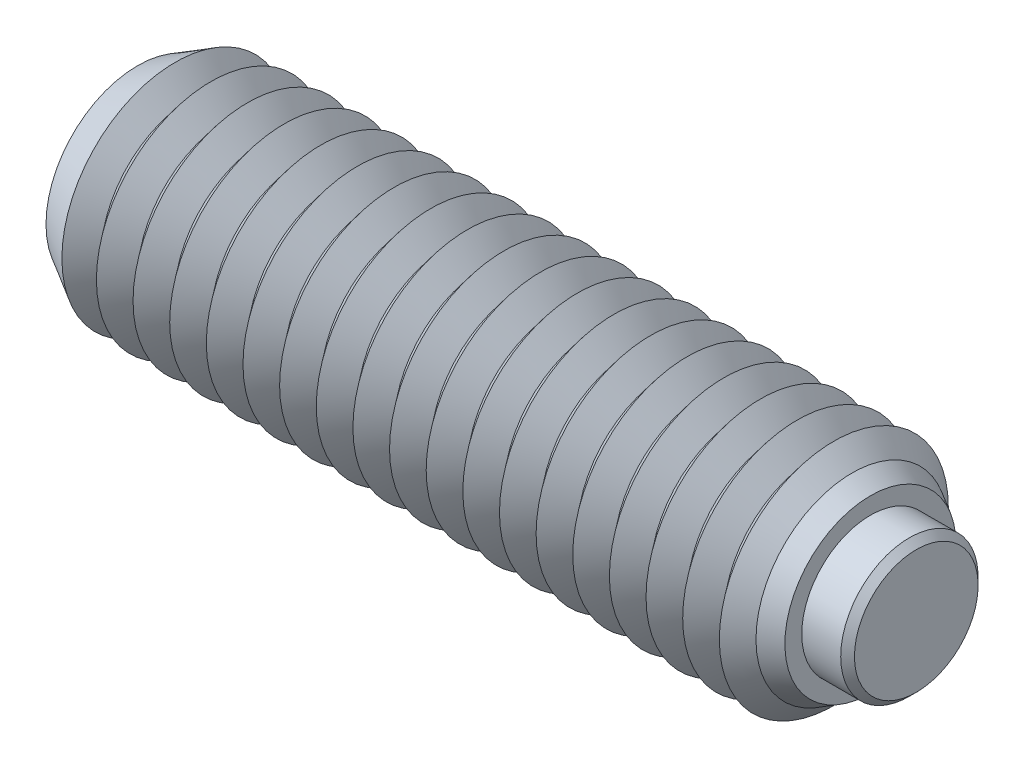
ISO-10303-21;
HEADER;
FILE_DESCRIPTION(('STEP AP214'),'2;1');
FILE_NAME('part.step','',(''),(''),'','','');
FILE_SCHEMA(('AUTOMOTIVE_DESIGN { 1 0 10303 214 1 1 1 1 }'));
ENDSEC;
DATA;
#1=APPLICATION_CONTEXT('core data for automotive mechanical design processes');
#2=APPLICATION_PROTOCOL_DEFINITION('international standard','automotive_design',2000,#1);
#3=PRODUCT_CONTEXT('',#1,'mechanical');
#4=PRODUCT('Part','Part','',(#3));
#5=PRODUCT_RELATED_PRODUCT_CATEGORY('part','',(#4));
#6=PRODUCT_DEFINITION_FORMATION('','',#4);
#7=PRODUCT_DEFINITION_CONTEXT('part definition',#1,'design');
#8=PRODUCT_DEFINITION('design','',#6,#7);
#9=PRODUCT_DEFINITION_SHAPE('','',#8);
#10=(LENGTH_UNIT() NAMED_UNIT(*) SI_UNIT(.MILLI.,.METRE.));
#11=(NAMED_UNIT(*) PLANE_ANGLE_UNIT() SI_UNIT($,.RADIAN.));
#12=(NAMED_UNIT(*) SI_UNIT($,.STERADIAN.) SOLID_ANGLE_UNIT());
#13=UNCERTAINTY_MEASURE_WITH_UNIT(LENGTH_MEASURE(1.E-05),#10,'distance_accuracy_value','');
#14=(GEOMETRIC_REPRESENTATION_CONTEXT(3) GLOBAL_UNCERTAINTY_ASSIGNED_CONTEXT((#13)) GLOBAL_UNIT_ASSIGNED_CONTEXT((#10,
#11,#12)) REPRESENTATION_CONTEXT('',''));
#15=CARTESIAN_POINT('',(0.,0.,0.));
#16=DIRECTION('',(0.,0.,1.));
#17=DIRECTION('',(1.,0.,0.));
#18=AXIS2_PLACEMENT_3D('',#15,#16,#17);
#19=CARTESIAN_POINT('',(1.4,0.,0.));
#20=DIRECTION('',(-1.,0.,0.));
#21=DIRECTION('',(0.,0.,1.));
#22=AXIS2_PLACEMENT_3D('',#19,#20,#21);
#23=CYLINDRICAL_SURFACE('',#22,1.5);
#24=CARTESIAN_POINT('',(1.25,0.,0.));
#25=DIRECTION('',(1.,0.,0.));
#26=DIRECTION('',(0.,0.,-1.));
#27=AXIS2_PLACEMENT_3D('',#24,#25,#26);
#28=CIRCLE('',#27,1.5);
#29=CARTESIAN_POINT('',(1.25,0.,1.5));
#30=VERTEX_POINT('',#29);
#31=EDGE_CURVE('P0_E10',#30,#30,#28,.F.);
#32=ORIENTED_EDGE('',*,*,#31,.T.);
#33=EDGE_LOOP('',(#32));
#34=FACE_BOUND('',#33,.T.);
#35=CARTESIAN_POINT('',(-0.6,0.,0.));
#36=DIRECTION('',(1.,0.,0.));
#37=DIRECTION('',(0.,0.,-1.));
#38=AXIS2_PLACEMENT_3D('',#35,#36,#37);
#39=CIRCLE('',#38,1.5);
#40=CARTESIAN_POINT('',(-0.6,0.,-1.5));
#41=VERTEX_POINT('',#40);
#42=EDGE_CURVE('P0_E25',#41,#41,#39,.T.);
#43=ORIENTED_EDGE('',*,*,#42,.T.);
#44=EDGE_LOOP('',(#43));
#45=FACE_BOUND('',#44,.T.);
#46=ADVANCED_FACE('P0_F14',(#34,#45),#23,.T.);
#47=CARTESIAN_POINT('',(1.4,0.,0.));
#48=DIRECTION('',(1.,0.,0.));
#49=DIRECTION('',(0.,0.,-1.));
#50=AXIS2_PLACEMENT_3D('',#47,#48,#49);
#51=PLANE('',#50);
#52=CARTESIAN_POINT('',(1.4,0.,0.));
#53=DIRECTION('',(1.,0.,0.));
#54=DIRECTION('',(0.,0.,-1.));
#55=AXIS2_PLACEMENT_3D('',#52,#53,#54);
#56=CIRCLE('',#55,1.35);
#57=CARTESIAN_POINT('',(1.4,0.,1.35));
#58=VERTEX_POINT('',#57);
#59=EDGE_CURVE('P0_E21',#58,#58,#56,.T.);
#60=ORIENTED_EDGE('',*,*,#59,.T.);
#61=EDGE_LOOP('',(#60));
#62=FACE_BOUND('',#61,.T.);
#63=ADVANCED_FACE('P0_F35',(#62),#51,.T.);
#64=CARTESIAN_POINT('',(-0.6,0.,0.));
#65=DIRECTION('',(1.,0.,0.));
#66=DIRECTION('',(0.,0.,-1.));
#67=AXIS2_PLACEMENT_3D('',#64,#65,#66);
#68=PLANE('',#67);
#69=ORIENTED_EDGE('',*,*,#42,.F.);
#70=EDGE_LOOP('',(#69));
#71=FACE_BOUND('',#70,.T.);
#72=ADVANCED_FACE('P0_F33',(#71),#68,.F.);
#73=CARTESIAN_POINT('',(1.4,0.,0.));
#74=DIRECTION('',(-1.,0.,0.));
#75=DIRECTION('',(0.,0.,1.));
#76=AXIS2_PLACEMENT_3D('',#73,#74,#75);
#77=CONICAL_SURFACE('',#76,1.35,0.785398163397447);
#78=CARTESIAN_POINT('',(1.25,0.,1.5));
#79=CARTESIAN_POINT('',(1.2515625,0.,1.4984375));
#80=CARTESIAN_POINT('',(1.253125,0.,1.496875));
#81=CARTESIAN_POINT('',(1.25625,0.,1.49375));
#82=CARTESIAN_POINT('',(1.2578125,0.,1.4921875));
#83=CARTESIAN_POINT('',(1.2609375,0.,1.4890625));
#84=CARTESIAN_POINT('',(1.2625,0.,1.4875));
#85=CARTESIAN_POINT('',(1.265625,0.,1.484375));
#86=CARTESIAN_POINT('',(1.2671875,0.,1.4828125));
#87=CARTESIAN_POINT('',(1.2703125,0.,1.4796875));
#88=CARTESIAN_POINT('',(1.271875,0.,1.478125));
#89=CARTESIAN_POINT('',(1.275,0.,1.475));
#90=CARTESIAN_POINT('',(1.2765625,0.,1.4734375));
#91=CARTESIAN_POINT('',(1.2796875,0.,1.4703125));
#92=CARTESIAN_POINT('',(1.28125,0.,1.46875));
#93=CARTESIAN_POINT('',(1.284375,0.,1.465625));
#94=CARTESIAN_POINT('',(1.2859375,0.,1.4640625));
#95=CARTESIAN_POINT('',(1.2890625,0.,1.4609375));
#96=CARTESIAN_POINT('',(1.290625,0.,1.459375));
#97=CARTESIAN_POINT('',(1.29375,0.,1.45625));
#98=CARTESIAN_POINT('',(1.2953125,0.,1.4546875));
#99=CARTESIAN_POINT('',(1.2984375,0.,1.4515625));
#100=CARTESIAN_POINT('',(1.3,0.,1.45));
#101=CARTESIAN_POINT('',(1.303125,0.,1.446875));
#102=CARTESIAN_POINT('',(1.3046875,0.,1.4453125));
#103=CARTESIAN_POINT('',(1.3078125,0.,1.4421875));
#104=CARTESIAN_POINT('',(1.309375,0.,1.440625));
#105=CARTESIAN_POINT('',(1.3125,0.,1.4375));
#106=CARTESIAN_POINT('',(1.3140625,0.,1.4359375));
#107=CARTESIAN_POINT('',(1.3171875,0.,1.4328125));
#108=CARTESIAN_POINT('',(1.31875,0.,1.43125));
#109=CARTESIAN_POINT('',(1.321875,0.,1.428125));
#110=CARTESIAN_POINT('',(1.3234375,0.,1.4265625));
#111=CARTESIAN_POINT('',(1.3265625,0.,1.4234375));
#112=CARTESIAN_POINT('',(1.328125,0.,1.421875));
#113=CARTESIAN_POINT('',(1.33125,0.,1.41875));
#114=CARTESIAN_POINT('',(1.3328125,0.,1.4171875));
#115=CARTESIAN_POINT('',(1.3359375,0.,1.4140625));
#116=CARTESIAN_POINT('',(1.3375,0.,1.4125));
#117=CARTESIAN_POINT('',(1.340625,0.,1.409375));
#118=CARTESIAN_POINT('',(1.3421875,0.,1.4078125));
#119=CARTESIAN_POINT('',(1.3453125,0.,1.4046875));
#120=CARTESIAN_POINT('',(1.346875,0.,1.403125));
#121=CARTESIAN_POINT('',(1.35,0.,1.4));
#122=CARTESIAN_POINT('',(1.3515625,0.,1.3984375));
#123=CARTESIAN_POINT('',(1.3546875,0.,1.3953125));
#124=CARTESIAN_POINT('',(1.35625,0.,1.39375));
#125=CARTESIAN_POINT('',(1.359375,0.,1.390625));
#126=CARTESIAN_POINT('',(1.3609375,0.,1.3890625));
#127=CARTESIAN_POINT('',(1.3640625,0.,1.3859375));
#128=CARTESIAN_POINT('',(1.365625,0.,1.384375));
#129=CARTESIAN_POINT('',(1.36875,0.,1.38125));
#130=CARTESIAN_POINT('',(1.3703125,0.,1.3796875));
#131=CARTESIAN_POINT('',(1.3734375,0.,1.3765625));
#132=CARTESIAN_POINT('',(1.375,0.,1.375));
#133=CARTESIAN_POINT('',(1.378125,0.,1.371875));
#134=CARTESIAN_POINT('',(1.3796875,0.,1.3703125));
#135=CARTESIAN_POINT('',(1.3828125,0.,1.3671875));
#136=CARTESIAN_POINT('',(1.384375,0.,1.365625));
#137=CARTESIAN_POINT('',(1.3875,0.,1.3625));
#138=CARTESIAN_POINT('',(1.3890625,0.,1.3609375));
#139=CARTESIAN_POINT('',(1.3921875,0.,1.3578125));
#140=CARTESIAN_POINT('',(1.39375,0.,1.35625));
#141=CARTESIAN_POINT('',(1.396875,0.,1.353125));
#142=CARTESIAN_POINT('',(1.3984375,0.,1.3515625));
#143=CARTESIAN_POINT('',(1.4,0.,1.35));
#144=B_SPLINE_CURVE_WITH_KNOTS('',3,(#78,#79,#80,#81,#82,#83,#84,#85,#86,#87,#88,#89,#90,#91,
#92,#93,#94,#95,#96,#97,#98,#99,#100,#101,#102,#103,#104,#105,#106,#107,#108,#109,#110,#111,
#112,#113,#114,#115,#116,#117,#118,#119,#120,#121,#122,#123,#124,#125,#126,#127,#128,#129,#130,
#131,#132,#133,#134,#135,#136,#137,#138,#139,#140,#141,#142,#143),.UNSPECIFIED.,.F.,.F.,(4,2,2,
2,2,2,2,2,2,2,2,2,2,2,2,2,2,2,2,2,2,2,2,2,2,2,2,2,2,2,2,2,4),(0.,0.00662912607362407,
0.0132582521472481,0.0198873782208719,0.0265165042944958,0.0331456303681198,0.0397747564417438,
0.0464038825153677,0.0530330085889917,0.0596621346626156,0.0662912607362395,0.0729203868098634,
0.0795495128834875,0.0861786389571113,0.0928077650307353,0.0994368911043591,0.106066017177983,
0.112695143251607,0.119324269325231,0.125953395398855,0.132582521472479,0.139211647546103,
0.145840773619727,0.152469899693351,0.159099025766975,0.165728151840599,0.172357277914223,
0.178986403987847,0.18561553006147,0.192244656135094,0.198873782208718,0.205502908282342,
0.212132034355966),.UNSPECIFIED.);
#145=EDGE_CURVE('P0_BSEAM16',#30,#58,#144,.T.);
#146=ORIENTED_EDGE('',*,*,#31,.F.);
#147=ORIENTED_EDGE('',*,*,#59,.F.);
#148=ORIENTED_EDGE('',*,*,#145,.T.);
#149=ORIENTED_EDGE('',*,*,#145,.F.);
#150=EDGE_LOOP('',(#146,#148,#147,#149));
#151=FACE_BOUND('',#150,.T.);
#152=ADVANCED_FACE('P0_F16',(#151),#77,.T.);
#153=CLOSED_SHELL('',(#46,#63,#72,#152));
#154=MANIFOLD_SOLID_BREP('P0_B1',#153);
#155=CARTESIAN_POINT('',(-14.8,0.,0.));
#156=DIRECTION('',(-1.,0.,0.));
#157=DIRECTION('',(0.,0.,1.));
#158=AXIS2_PLACEMENT_3D('',#155,#156,#157);
#159=CONICAL_SURFACE('',#158,2.5,0.895664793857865);
#160=CARTESIAN_POINT('',(-14.4,0.,0.));
#161=DIRECTION('',(1.,0.,0.));
#162=DIRECTION('',(0.,0.,-1.));
#163=AXIS2_PLACEMENT_3D('',#160,#161,#162);
#164=CIRCLE('',#163,2.00040016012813);
#165=CARTESIAN_POINT('',(-14.4,0.,-2.00040016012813));
#166=VERTEX_POINT('',#165);
#167=EDGE_CURVE('P1_E957',#166,#166,#164,.T.);
#168=ORIENTED_EDGE('',*,*,#167,.F.);
#169=EDGE_LOOP('',(#168));
#170=FACE_BOUND('',#169,.T.);
#171=CARTESIAN_POINT('',(-14.7793469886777,0.,0.));
#172=DIRECTION('',(1.,0.,0.));
#173=DIRECTION('',(0.,0.,-1.));
#174=AXIS2_PLACEMENT_3D('',#171,#172,#173);
#175=CIRCLE('',#174,2.47420439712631);
#176=CARTESIAN_POINT('',(-14.7793469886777,0.,-2.47420439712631));
#177=VERTEX_POINT('',#176);
#178=EDGE_CURVE('P1_E960',#177,#177,#175,.F.);
#179=ORIENTED_EDGE('',*,*,#178,.F.);
#180=EDGE_LOOP('',(#179));
#181=FACE_BOUND('',#180,.T.);
#182=ADVANCED_FACE('P1_F15',(#170,#181),#159,.T.);
#183=CARTESIAN_POINT('',(-0.800000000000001,0.,0.));
#184=DIRECTION('',(1.,0.,0.));
#185=DIRECTION('',(0.,0.,-1.));
#186=AXIS2_PLACEMENT_3D('',#183,#184,#185);
#187=CONICAL_SURFACE('',#186,2.00040016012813,0.895664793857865);
#188=CARTESIAN_POINT('',(-0.400000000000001,0.,0.));
#189=DIRECTION('',(1.,0.,0.));
#190=DIRECTION('',(0.,0.,-1.));
#191=AXIS2_PLACEMENT_3D('',#188,#189,#190);
#192=CIRCLE('',#191,2.5);
#193=CARTESIAN_POINT('',(-0.400000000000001,0.,-2.5));
#194=VERTEX_POINT('',#193);
#195=EDGE_CURVE('P1_E851',#194,#194,#192,.T.);
#196=ORIENTED_EDGE('',*,*,#195,.F.);
#197=EDGE_LOOP('',(#196));
#198=FACE_BOUND('',#197,.T.);
#199=CARTESIAN_POINT('',(-0.800000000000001,0.,0.));
#200=DIRECTION('',(1.,0.,0.));
#201=DIRECTION('',(0.,0.,-1.));
#202=AXIS2_PLACEMENT_3D('',#199,#200,#201);
#203=CIRCLE('',#202,2.00040016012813);
#204=CARTESIAN_POINT('',(-0.800000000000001,0.,-2.00040016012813));
#205=VERTEX_POINT('',#204);
#206=EDGE_CURVE('P1_E852',#205,#205,#203,.T.);
#207=ORIENTED_EDGE('',*,*,#206,.T.);
#208=EDGE_LOOP('',(#207));
#209=FACE_BOUND('',#208,.T.);
#210=ADVANCED_FACE('P1_F222',(#198,#209),#187,.T.);
#211=CARTESIAN_POINT('',(-1.2,0.,0.));
#212=DIRECTION('',(-1.,0.,0.));
#213=DIRECTION('',(0.,0.,1.));
#214=AXIS2_PLACEMENT_3D('',#211,#212,#213);
#215=CONICAL_SURFACE('',#214,2.5,0.895664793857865);
#216=ORIENTED_EDGE('',*,*,#206,.F.);
#217=EDGE_LOOP('',(#216));
#218=FACE_BOUND('',#217,.T.);
#219=CARTESIAN_POINT('',(-1.2,0.,0.));
#220=DIRECTION('',(1.,0.,0.));
#221=DIRECTION('',(0.,0.,-1.));
#222=AXIS2_PLACEMENT_3D('',#219,#220,#221);
#223=CIRCLE('',#222,2.5);
#224=CARTESIAN_POINT('',(-1.2,0.,-2.5));
#225=VERTEX_POINT('',#224);
#226=EDGE_CURVE('P1_E856',#225,#225,#223,.T.);
#227=ORIENTED_EDGE('',*,*,#226,.T.);
#228=EDGE_LOOP('',(#227));
#229=FACE_BOUND('',#228,.T.);
#230=ADVANCED_FACE('P1_F227',(#218,#229),#215,.T.);
#231=CARTESIAN_POINT('',(-0.6,0.,0.));
#232=DIRECTION('',(1.,0.,0.));
#233=DIRECTION('',(0.,1.,0.));
#234=AXIS2_PLACEMENT_3D('',#231,#232,#233);
#235=PLANE('',#234);
#236=CARTESIAN_POINT('',(-0.6,0.,0.));
#237=DIRECTION('',(1.,0.,0.));
#238=DIRECTION('',(0.,1.,0.));
#239=AXIS2_PLACEMENT_3D('',#236,#237,#238);
#240=CIRCLE('',#239,1.5);
#241=CARTESIAN_POINT('',(-0.6,1.5,0.));
#242=VERTEX_POINT('',#241);
#243=EDGE_CURVE('P1_E438',#242,#242,#240,.T.);
#244=ORIENTED_EDGE('',*,*,#243,.T.);
#245=EDGE_LOOP('',(#244));
#246=FACE_BOUND('',#245,.T.);
#247=ADVANCED_FACE('P1_F365',(#246),#235,.T.);
#248=CARTESIAN_POINT('',(-0.6,0.,0.));
#249=DIRECTION('',(1.,0.,0.));
#250=DIRECTION('',(0.,1.,0.));
#251=AXIS2_PLACEMENT_3D('',#248,#249,#250);
#252=CYLINDRICAL_SURFACE('',#251,1.5);
#253=ORIENTED_EDGE('',*,*,#243,.F.);
#254=EDGE_LOOP('',(#253));
#255=FACE_BOUND('',#254,.T.);
#256=CARTESIAN_POINT('',(0.4,0.,0.));
#257=DIRECTION('',(1.,0.,0.));
#258=DIRECTION('',(0.,1.,0.));
#259=AXIS2_PLACEMENT_3D('',#256,#257,#258);
#260=CIRCLE('',#259,1.5);
#261=CARTESIAN_POINT('',(0.4,1.5,0.));
#262=VERTEX_POINT('',#261);
#263=EDGE_CURVE('P1_E441',#262,#262,#260,.T.);
#264=ORIENTED_EDGE('',*,*,#263,.T.);
#265=EDGE_LOOP('',(#264));
#266=FACE_BOUND('',#265,.T.);
#267=ADVANCED_FACE('P1_F209',(#255,#266),#252,.F.);
#268=CARTESIAN_POINT('',(0.4,1.86905989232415,0.));
#269=DIRECTION('',(1.,0.,0.));
#270=DIRECTION('',(0.,1.,0.));
#271=AXIS2_PLACEMENT_3D('',#268,#269,#270);
#272=PLANE('',#271);
#273=ORIENTED_EDGE('',*,*,#263,.F.);
#274=EDGE_LOOP('',(#273));
#275=FACE_BOUND('',#274,.T.);
#276=CARTESIAN_POINT('',(0.4,0.,0.));
#277=DIRECTION('',(1.,0.,0.));
#278=DIRECTION('',(0.,1.,0.));
#279=AXIS2_PLACEMENT_3D('',#276,#277,#278);
#280=CIRCLE('',#279,1.86905989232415);
#281=CARTESIAN_POINT('',(0.4,1.86905989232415,0.));
#282=VERTEX_POINT('',#281);
#283=EDGE_CURVE('P1_E121',#282,#282,#280,.T.);
#284=ORIENTED_EDGE('',*,*,#283,.T.);
#285=EDGE_LOOP('',(#284));
#286=FACE_BOUND('',#285,.T.);
#287=ADVANCED_FACE('P1_F206',(#275,#286),#272,.T.);
#288=CARTESIAN_POINT('',(0.4,0.,0.));
#289=DIRECTION('',(-1.,0.,0.));
#290=DIRECTION('',(0.,-1.,0.));
#291=AXIS2_PLACEMENT_3D('',#288,#289,#290);
#292=CONICAL_SURFACE('',#291,1.86905989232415,0.523598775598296);
#293=CARTESIAN_POINT('',(0.,0.,0.));
#294=DIRECTION('',(1.,0.,0.));
#295=DIRECTION('',(0.,0.,-1.));
#296=AXIS2_PLACEMENT_3D('',#293,#294,#295);
#297=CIRCLE('',#296,2.1);
#298=CARTESIAN_POINT('',(0.,0.,-2.1));
#299=VERTEX_POINT('',#298);
#300=EDGE_CURVE('P1_E429',#299,#299,#297,.T.);
#301=ORIENTED_EDGE('',*,*,#300,.T.);
#302=EDGE_LOOP('',(#301));
#303=FACE_BOUND('',#302,.T.);
#304=ORIENTED_EDGE('',*,*,#283,.F.);
#305=EDGE_LOOP('',(#304));
#306=FACE_BOUND('',#305,.T.);
#307=ADVANCED_FACE('P1_F203',(#303,#306),#292,.T.);
#308=CARTESIAN_POINT('',(0.,0.,0.));
#309=DIRECTION('',(-1.,0.,0.));
#310=DIRECTION('',(0.,0.,1.));
#311=AXIS2_PLACEMENT_3D('',#308,#309,#310);
#312=CONICAL_SURFACE('',#311,2.1,0.785398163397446);
#313=ORIENTED_EDGE('',*,*,#195,.T.);
#314=EDGE_LOOP('',(#313));
#315=FACE_BOUND('',#314,.T.);
#316=ORIENTED_EDGE('',*,*,#300,.F.);
#317=EDGE_LOOP('',(#316));
#318=FACE_BOUND('',#317,.T.);
#319=ADVANCED_FACE('P1_F17',(#315,#318),#312,.T.);
#320=CARTESIAN_POINT('',(-1.6,0.,0.));
#321=DIRECTION('',(1.,0.,0.));
#322=DIRECTION('',(0.,0.,-1.));
#323=AXIS2_PLACEMENT_3D('',#320,#321,#322);
#324=CONICAL_SURFACE('',#323,2.00040016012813,0.895664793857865);
#325=ORIENTED_EDGE('',*,*,#226,.F.);
#326=EDGE_LOOP('',(#325));
#327=FACE_BOUND('',#326,.T.);
#328=CARTESIAN_POINT('',(-1.6,0.,0.));
#329=DIRECTION('',(1.,0.,0.));
#330=DIRECTION('',(0.,0.,-1.));
#331=AXIS2_PLACEMENT_3D('',#328,#329,#330);
#332=CIRCLE('',#331,2.00040016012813);
#333=CARTESIAN_POINT('',(-1.6,0.,-2.00040016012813));
#334=VERTEX_POINT('',#333);
#335=EDGE_CURVE('P1_E861',#334,#334,#332,.T.);
#336=ORIENTED_EDGE('',*,*,#335,.T.);
#337=EDGE_LOOP('',(#336));
#338=FACE_BOUND('',#337,.T.);
#339=ADVANCED_FACE('P1_F359',(#327,#338),#324,.T.);
#340=CARTESIAN_POINT('',(-2.,0.,0.));
#341=DIRECTION('',(-1.,0.,0.));
#342=DIRECTION('',(0.,0.,1.));
#343=AXIS2_PLACEMENT_3D('',#340,#341,#342);
#344=CONICAL_SURFACE('',#343,2.5,0.895664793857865);
#345=ORIENTED_EDGE('',*,*,#335,.F.);
#346=EDGE_LOOP('',(#345));
#347=FACE_BOUND('',#346,.T.);
#348=CARTESIAN_POINT('',(-2.,0.,0.));
#349=DIRECTION('',(1.,0.,0.));
#350=DIRECTION('',(0.,0.,-1.));
#351=AXIS2_PLACEMENT_3D('',#348,#349,#350);
#352=CIRCLE('',#351,2.5);
#353=CARTESIAN_POINT('',(-2.,0.,-2.5));
#354=VERTEX_POINT('',#353);
#355=EDGE_CURVE('P1_E864',#354,#354,#352,.T.);
#356=ORIENTED_EDGE('',*,*,#355,.T.);
#357=EDGE_LOOP('',(#356));
#358=FACE_BOUND('',#357,.T.);
#359=ADVANCED_FACE('P1_F355',(#347,#358),#344,.T.);
#360=CARTESIAN_POINT('',(-2.4,0.,0.));
#361=DIRECTION('',(1.,0.,0.));
#362=DIRECTION('',(0.,0.,-1.));
#363=AXIS2_PLACEMENT_3D('',#360,#361,#362);
#364=CONICAL_SURFACE('',#363,2.00040016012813,0.895664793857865);
#365=ORIENTED_EDGE('',*,*,#355,.F.);
#366=EDGE_LOOP('',(#365));
#367=FACE_BOUND('',#366,.T.);
#368=CARTESIAN_POINT('',(-2.4,0.,0.));
#369=DIRECTION('',(1.,0.,0.));
#370=DIRECTION('',(0.,0.,-1.));
#371=AXIS2_PLACEMENT_3D('',#368,#369,#370);
#372=CIRCLE('',#371,2.00040016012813);
#373=CARTESIAN_POINT('',(-2.4,0.,-2.00040016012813));
#374=VERTEX_POINT('',#373);
#375=EDGE_CURVE('P1_E867',#374,#374,#372,.T.);
#376=ORIENTED_EDGE('',*,*,#375,.T.);
#377=EDGE_LOOP('',(#376));
#378=FACE_BOUND('',#377,.T.);
#379=ADVANCED_FACE('P1_F351',(#367,#378),#364,.T.);
#380=CARTESIAN_POINT('',(-2.8,0.,0.));
#381=DIRECTION('',(-1.,0.,0.));
#382=DIRECTION('',(0.,0.,1.));
#383=AXIS2_PLACEMENT_3D('',#380,#381,#382);
#384=CONICAL_SURFACE('',#383,2.5,0.895664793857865);
#385=ORIENTED_EDGE('',*,*,#375,.F.);
#386=EDGE_LOOP('',(#385));
#387=FACE_BOUND('',#386,.T.);
#388=CARTESIAN_POINT('',(-2.8,0.,0.));
#389=DIRECTION('',(1.,0.,0.));
#390=DIRECTION('',(0.,0.,-1.));
#391=AXIS2_PLACEMENT_3D('',#388,#389,#390);
#392=CIRCLE('',#391,2.5);
#393=CARTESIAN_POINT('',(-2.8,0.,-2.5));
#394=VERTEX_POINT('',#393);
#395=EDGE_CURVE('P1_E870',#394,#394,#392,.T.);
#396=ORIENTED_EDGE('',*,*,#395,.T.);
#397=EDGE_LOOP('',(#396));
#398=FACE_BOUND('',#397,.T.);
#399=ADVANCED_FACE('P1_F347',(#387,#398),#384,.T.);
#400=CARTESIAN_POINT('',(-3.2,0.,0.));
#401=DIRECTION('',(1.,0.,0.));
#402=DIRECTION('',(0.,0.,-1.));
#403=AXIS2_PLACEMENT_3D('',#400,#401,#402);
#404=CONICAL_SURFACE('',#403,2.00040016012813,0.895664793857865);
#405=ORIENTED_EDGE('',*,*,#395,.F.);
#406=EDGE_LOOP('',(#405));
#407=FACE_BOUND('',#406,.T.);
#408=CARTESIAN_POINT('',(-3.2,0.,0.));
#409=DIRECTION('',(1.,0.,0.));
#410=DIRECTION('',(0.,0.,-1.));
#411=AXIS2_PLACEMENT_3D('',#408,#409,#410);
#412=CIRCLE('',#411,2.00040016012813);
#413=CARTESIAN_POINT('',(-3.2,0.,-2.00040016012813));
#414=VERTEX_POINT('',#413);
#415=EDGE_CURVE('P1_E873',#414,#414,#412,.T.);
#416=ORIENTED_EDGE('',*,*,#415,.T.);
#417=EDGE_LOOP('',(#416));
#418=FACE_BOUND('',#417,.T.);
#419=ADVANCED_FACE('P1_F343',(#407,#418),#404,.T.);
#420=CARTESIAN_POINT('',(-3.6,0.,0.));
#421=DIRECTION('',(-1.,0.,0.));
#422=DIRECTION('',(0.,0.,1.));
#423=AXIS2_PLACEMENT_3D('',#420,#421,#422);
#424=CONICAL_SURFACE('',#423,2.5,0.895664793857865);
#425=ORIENTED_EDGE('',*,*,#415,.F.);
#426=EDGE_LOOP('',(#425));
#427=FACE_BOUND('',#426,.T.);
#428=CARTESIAN_POINT('',(-3.6,0.,0.));
#429=DIRECTION('',(1.,0.,0.));
#430=DIRECTION('',(0.,0.,-1.));
#431=AXIS2_PLACEMENT_3D('',#428,#429,#430);
#432=CIRCLE('',#431,2.5);
#433=CARTESIAN_POINT('',(-3.6,0.,-2.5));
#434=VERTEX_POINT('',#433);
#435=EDGE_CURVE('P1_E876',#434,#434,#432,.T.);
#436=ORIENTED_EDGE('',*,*,#435,.T.);
#437=EDGE_LOOP('',(#436));
#438=FACE_BOUND('',#437,.T.);
#439=ADVANCED_FACE('P1_F339',(#427,#438),#424,.T.);
#440=CARTESIAN_POINT('',(-4.,0.,0.));
#441=DIRECTION('',(1.,0.,0.));
#442=DIRECTION('',(0.,0.,-1.));
#443=AXIS2_PLACEMENT_3D('',#440,#441,#442);
#444=CONICAL_SURFACE('',#443,2.00040016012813,0.895664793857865);
#445=ORIENTED_EDGE('',*,*,#435,.F.);
#446=EDGE_LOOP('',(#445));
#447=FACE_BOUND('',#446,.T.);
#448=CARTESIAN_POINT('',(-4.,0.,0.));
#449=DIRECTION('',(1.,0.,0.));
#450=DIRECTION('',(0.,0.,-1.));
#451=AXIS2_PLACEMENT_3D('',#448,#449,#450);
#452=CIRCLE('',#451,2.00040016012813);
#453=CARTESIAN_POINT('',(-4.,0.,-2.00040016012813));
#454=VERTEX_POINT('',#453);
#455=EDGE_CURVE('P1_E879',#454,#454,#452,.T.);
#456=ORIENTED_EDGE('',*,*,#455,.T.);
#457=EDGE_LOOP('',(#456));
#458=FACE_BOUND('',#457,.T.);
#459=ADVANCED_FACE('P1_F335',(#447,#458),#444,.T.);
#460=CARTESIAN_POINT('',(-4.4,0.,0.));
#461=DIRECTION('',(-1.,0.,0.));
#462=DIRECTION('',(0.,0.,1.));
#463=AXIS2_PLACEMENT_3D('',#460,#461,#462);
#464=CONICAL_SURFACE('',#463,2.5,0.895664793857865);
#465=ORIENTED_EDGE('',*,*,#455,.F.);
#466=EDGE_LOOP('',(#465));
#467=FACE_BOUND('',#466,.T.);
#468=CARTESIAN_POINT('',(-4.4,0.,0.));
#469=DIRECTION('',(1.,0.,0.));
#470=DIRECTION('',(0.,0.,-1.));
#471=AXIS2_PLACEMENT_3D('',#468,#469,#470);
#472=CIRCLE('',#471,2.5);
#473=CARTESIAN_POINT('',(-4.4,0.,-2.5));
#474=VERTEX_POINT('',#473);
#475=EDGE_CURVE('P1_E882',#474,#474,#472,.T.);
#476=ORIENTED_EDGE('',*,*,#475,.T.);
#477=EDGE_LOOP('',(#476));
#478=FACE_BOUND('',#477,.T.);
#479=ADVANCED_FACE('P1_F331',(#467,#478),#464,.T.);
#480=CARTESIAN_POINT('',(-4.8,0.,0.));
#481=DIRECTION('',(1.,0.,0.));
#482=DIRECTION('',(0.,0.,-1.));
#483=AXIS2_PLACEMENT_3D('',#480,#481,#482);
#484=CONICAL_SURFACE('',#483,2.00040016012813,0.895664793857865);
#485=ORIENTED_EDGE('',*,*,#475,.F.);
#486=EDGE_LOOP('',(#485));
#487=FACE_BOUND('',#486,.T.);
#488=CARTESIAN_POINT('',(-4.8,0.,0.));
#489=DIRECTION('',(1.,0.,0.));
#490=DIRECTION('',(0.,0.,-1.));
#491=AXIS2_PLACEMENT_3D('',#488,#489,#490);
#492=CIRCLE('',#491,2.00040016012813);
#493=CARTESIAN_POINT('',(-4.8,0.,-2.00040016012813));
#494=VERTEX_POINT('',#493);
#495=EDGE_CURVE('P1_E885',#494,#494,#492,.T.);
#496=ORIENTED_EDGE('',*,*,#495,.T.);
#497=EDGE_LOOP('',(#496));
#498=FACE_BOUND('',#497,.T.);
#499=ADVANCED_FACE('P1_F327',(#487,#498),#484,.T.);
#500=CARTESIAN_POINT('',(-5.2,0.,0.));
#501=DIRECTION('',(-1.,0.,0.));
#502=DIRECTION('',(0.,0.,1.));
#503=AXIS2_PLACEMENT_3D('',#500,#501,#502);
#504=CONICAL_SURFACE('',#503,2.5,0.895664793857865);
#505=ORIENTED_EDGE('',*,*,#495,.F.);
#506=EDGE_LOOP('',(#505));
#507=FACE_BOUND('',#506,.T.);
#508=CARTESIAN_POINT('',(-5.2,0.,0.));
#509=DIRECTION('',(1.,0.,0.));
#510=DIRECTION('',(0.,0.,-1.));
#511=AXIS2_PLACEMENT_3D('',#508,#509,#510);
#512=CIRCLE('',#511,2.5);
#513=CARTESIAN_POINT('',(-5.2,0.,-2.5));
#514=VERTEX_POINT('',#513);
#515=EDGE_CURVE('P1_E888',#514,#514,#512,.T.);
#516=ORIENTED_EDGE('',*,*,#515,.T.);
#517=EDGE_LOOP('',(#516));
#518=FACE_BOUND('',#517,.T.);
#519=ADVANCED_FACE('P1_F323',(#507,#518),#504,.T.);
#520=CARTESIAN_POINT('',(-5.6,0.,0.));
#521=DIRECTION('',(1.,0.,0.));
#522=DIRECTION('',(0.,0.,-1.));
#523=AXIS2_PLACEMENT_3D('',#520,#521,#522);
#524=CONICAL_SURFACE('',#523,2.00040016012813,0.895664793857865);
#525=ORIENTED_EDGE('',*,*,#515,.F.);
#526=EDGE_LOOP('',(#525));
#527=FACE_BOUND('',#526,.T.);
#528=CARTESIAN_POINT('',(-5.6,0.,0.));
#529=DIRECTION('',(1.,0.,0.));
#530=DIRECTION('',(0.,0.,-1.));
#531=AXIS2_PLACEMENT_3D('',#528,#529,#530);
#532=CIRCLE('',#531,2.00040016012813);
#533=CARTESIAN_POINT('',(-5.6,0.,-2.00040016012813));
#534=VERTEX_POINT('',#533);
#535=EDGE_CURVE('P1_E891',#534,#534,#532,.T.);
#536=ORIENTED_EDGE('',*,*,#535,.T.);
#537=EDGE_LOOP('',(#536));
#538=FACE_BOUND('',#537,.T.);
#539=ADVANCED_FACE('P1_F319',(#527,#538),#524,.T.);
#540=CARTESIAN_POINT('',(-6.,0.,0.));
#541=DIRECTION('',(-1.,0.,0.));
#542=DIRECTION('',(0.,0.,1.));
#543=AXIS2_PLACEMENT_3D('',#540,#541,#542);
#544=CONICAL_SURFACE('',#543,2.5,0.895664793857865);
#545=ORIENTED_EDGE('',*,*,#535,.F.);
#546=EDGE_LOOP('',(#545));
#547=FACE_BOUND('',#546,.T.);
#548=CARTESIAN_POINT('',(-6.,0.,0.));
#549=DIRECTION('',(1.,0.,0.));
#550=DIRECTION('',(0.,0.,-1.));
#551=AXIS2_PLACEMENT_3D('',#548,#549,#550);
#552=CIRCLE('',#551,2.5);
#553=CARTESIAN_POINT('',(-6.,0.,-2.5));
#554=VERTEX_POINT('',#553);
#555=EDGE_CURVE('P1_E894',#554,#554,#552,.T.);
#556=ORIENTED_EDGE('',*,*,#555,.T.);
#557=EDGE_LOOP('',(#556));
#558=FACE_BOUND('',#557,.T.);
#559=ADVANCED_FACE('P1_F315',(#547,#558),#544,.T.);
#560=CARTESIAN_POINT('',(-6.4,0.,0.));
#561=DIRECTION('',(1.,0.,0.));
#562=DIRECTION('',(0.,0.,-1.));
#563=AXIS2_PLACEMENT_3D('',#560,#561,#562);
#564=CONICAL_SURFACE('',#563,2.00040016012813,0.895664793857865);
#565=ORIENTED_EDGE('',*,*,#555,.F.);
#566=EDGE_LOOP('',(#565));
#567=FACE_BOUND('',#566,.T.);
#568=CARTESIAN_POINT('',(-6.4,0.,0.));
#569=DIRECTION('',(1.,0.,0.));
#570=DIRECTION('',(0.,0.,-1.));
#571=AXIS2_PLACEMENT_3D('',#568,#569,#570);
#572=CIRCLE('',#571,2.00040016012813);
#573=CARTESIAN_POINT('',(-6.4,0.,-2.00040016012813));
#574=VERTEX_POINT('',#573);
#575=EDGE_CURVE('P1_E897',#574,#574,#572,.T.);
#576=ORIENTED_EDGE('',*,*,#575,.T.);
#577=EDGE_LOOP('',(#576));
#578=FACE_BOUND('',#577,.T.);
#579=ADVANCED_FACE('P1_F311',(#567,#578),#564,.T.);
#580=CARTESIAN_POINT('',(-6.8,0.,0.));
#581=DIRECTION('',(-1.,0.,0.));
#582=DIRECTION('',(0.,0.,1.));
#583=AXIS2_PLACEMENT_3D('',#580,#581,#582);
#584=CONICAL_SURFACE('',#583,2.5,0.895664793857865);
#585=ORIENTED_EDGE('',*,*,#575,.F.);
#586=EDGE_LOOP('',(#585));
#587=FACE_BOUND('',#586,.T.);
#588=CARTESIAN_POINT('',(-6.8,0.,0.));
#589=DIRECTION('',(1.,0.,0.));
#590=DIRECTION('',(0.,0.,-1.));
#591=AXIS2_PLACEMENT_3D('',#588,#589,#590);
#592=CIRCLE('',#591,2.5);
#593=CARTESIAN_POINT('',(-6.8,0.,-2.5));
#594=VERTEX_POINT('',#593);
#595=EDGE_CURVE('P1_E900',#594,#594,#592,.T.);
#596=ORIENTED_EDGE('',*,*,#595,.T.);
#597=EDGE_LOOP('',(#596));
#598=FACE_BOUND('',#597,.T.);
#599=ADVANCED_FACE('P1_F307',(#587,#598),#584,.T.);
#600=CARTESIAN_POINT('',(-7.2,0.,0.));
#601=DIRECTION('',(1.,0.,0.));
#602=DIRECTION('',(0.,0.,-1.));
#603=AXIS2_PLACEMENT_3D('',#600,#601,#602);
#604=CONICAL_SURFACE('',#603,2.00040016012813,0.895664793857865);
#605=ORIENTED_EDGE('',*,*,#595,.F.);
#606=EDGE_LOOP('',(#605));
#607=FACE_BOUND('',#606,.T.);
#608=CARTESIAN_POINT('',(-7.2,0.,0.));
#609=DIRECTION('',(1.,0.,0.));
#610=DIRECTION('',(0.,0.,-1.));
#611=AXIS2_PLACEMENT_3D('',#608,#609,#610);
#612=CIRCLE('',#611,2.00040016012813);
#613=CARTESIAN_POINT('',(-7.2,0.,-2.00040016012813));
#614=VERTEX_POINT('',#613);
#615=EDGE_CURVE('P1_E903',#614,#614,#612,.T.);
#616=ORIENTED_EDGE('',*,*,#615,.T.);
#617=EDGE_LOOP('',(#616));
#618=FACE_BOUND('',#617,.T.);
#619=ADVANCED_FACE('P1_F303',(#607,#618),#604,.T.);
#620=CARTESIAN_POINT('',(-7.6,0.,0.));
#621=DIRECTION('',(-1.,0.,0.));
#622=DIRECTION('',(0.,0.,1.));
#623=AXIS2_PLACEMENT_3D('',#620,#621,#622);
#624=CONICAL_SURFACE('',#623,2.5,0.895664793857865);
#625=ORIENTED_EDGE('',*,*,#615,.F.);
#626=EDGE_LOOP('',(#625));
#627=FACE_BOUND('',#626,.T.);
#628=CARTESIAN_POINT('',(-7.6,0.,0.));
#629=DIRECTION('',(1.,0.,0.));
#630=DIRECTION('',(0.,0.,-1.));
#631=AXIS2_PLACEMENT_3D('',#628,#629,#630);
#632=CIRCLE('',#631,2.5);
#633=CARTESIAN_POINT('',(-7.6,0.,-2.5));
#634=VERTEX_POINT('',#633);
#635=EDGE_CURVE('P1_E906',#634,#634,#632,.T.);
#636=ORIENTED_EDGE('',*,*,#635,.T.);
#637=EDGE_LOOP('',(#636));
#638=FACE_BOUND('',#637,.T.);
#639=ADVANCED_FACE('P1_F299',(#627,#638),#624,.T.);
#640=CARTESIAN_POINT('',(-8.,0.,0.));
#641=DIRECTION('',(1.,0.,0.));
#642=DIRECTION('',(0.,0.,-1.));
#643=AXIS2_PLACEMENT_3D('',#640,#641,#642);
#644=CONICAL_SURFACE('',#643,2.00040016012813,0.895664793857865);
#645=ORIENTED_EDGE('',*,*,#635,.F.);
#646=EDGE_LOOP('',(#645));
#647=FACE_BOUND('',#646,.T.);
#648=CARTESIAN_POINT('',(-8.,0.,0.));
#649=DIRECTION('',(1.,0.,0.));
#650=DIRECTION('',(0.,0.,-1.));
#651=AXIS2_PLACEMENT_3D('',#648,#649,#650);
#652=CIRCLE('',#651,2.00040016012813);
#653=CARTESIAN_POINT('',(-8.,0.,-2.00040016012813));
#654=VERTEX_POINT('',#653);
#655=EDGE_CURVE('P1_E909',#654,#654,#652,.T.);
#656=ORIENTED_EDGE('',*,*,#655,.T.);
#657=EDGE_LOOP('',(#656));
#658=FACE_BOUND('',#657,.T.);
#659=ADVANCED_FACE('P1_F295',(#647,#658),#644,.T.);
#660=CARTESIAN_POINT('',(-8.4,0.,0.));
#661=DIRECTION('',(-1.,0.,0.));
#662=DIRECTION('',(0.,0.,1.));
#663=AXIS2_PLACEMENT_3D('',#660,#661,#662);
#664=CONICAL_SURFACE('',#663,2.5,0.895664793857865);
#665=ORIENTED_EDGE('',*,*,#655,.F.);
#666=EDGE_LOOP('',(#665));
#667=FACE_BOUND('',#666,.T.);
#668=CARTESIAN_POINT('',(-8.4,0.,0.));
#669=DIRECTION('',(1.,0.,0.));
#670=DIRECTION('',(0.,0.,-1.));
#671=AXIS2_PLACEMENT_3D('',#668,#669,#670);
#672=CIRCLE('',#671,2.5);
#673=CARTESIAN_POINT('',(-8.4,0.,-2.5));
#674=VERTEX_POINT('',#673);
#675=EDGE_CURVE('P1_E912',#674,#674,#672,.T.);
#676=ORIENTED_EDGE('',*,*,#675,.T.);
#677=EDGE_LOOP('',(#676));
#678=FACE_BOUND('',#677,.T.);
#679=ADVANCED_FACE('P1_F291',(#667,#678),#664,.T.);
#680=CARTESIAN_POINT('',(-8.8,0.,0.));
#681=DIRECTION('',(1.,0.,0.));
#682=DIRECTION('',(0.,0.,-1.));
#683=AXIS2_PLACEMENT_3D('',#680,#681,#682);
#684=CONICAL_SURFACE('',#683,2.00040016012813,0.895664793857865);
#685=ORIENTED_EDGE('',*,*,#675,.F.);
#686=EDGE_LOOP('',(#685));
#687=FACE_BOUND('',#686,.T.);
#688=CARTESIAN_POINT('',(-8.8,0.,0.));
#689=DIRECTION('',(1.,0.,0.));
#690=DIRECTION('',(0.,0.,-1.));
#691=AXIS2_PLACEMENT_3D('',#688,#689,#690);
#692=CIRCLE('',#691,2.00040016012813);
#693=CARTESIAN_POINT('',(-8.8,0.,-2.00040016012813));
#694=VERTEX_POINT('',#693);
#695=EDGE_CURVE('P1_E915',#694,#694,#692,.T.);
#696=ORIENTED_EDGE('',*,*,#695,.T.);
#697=EDGE_LOOP('',(#696));
#698=FACE_BOUND('',#697,.T.);
#699=ADVANCED_FACE('P1_F287',(#687,#698),#684,.T.);
#700=CARTESIAN_POINT('',(-9.2,0.,0.));
#701=DIRECTION('',(-1.,0.,0.));
#702=DIRECTION('',(0.,0.,1.));
#703=AXIS2_PLACEMENT_3D('',#700,#701,#702);
#704=CONICAL_SURFACE('',#703,2.5,0.895664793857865);
#705=ORIENTED_EDGE('',*,*,#695,.F.);
#706=EDGE_LOOP('',(#705));
#707=FACE_BOUND('',#706,.T.);
#708=CARTESIAN_POINT('',(-9.2,0.,0.));
#709=DIRECTION('',(1.,0.,0.));
#710=DIRECTION('',(0.,0.,-1.));
#711=AXIS2_PLACEMENT_3D('',#708,#709,#710);
#712=CIRCLE('',#711,2.5);
#713=CARTESIAN_POINT('',(-9.2,0.,-2.5));
#714=VERTEX_POINT('',#713);
#715=EDGE_CURVE('P1_E918',#714,#714,#712,.T.);
#716=ORIENTED_EDGE('',*,*,#715,.T.);
#717=EDGE_LOOP('',(#716));
#718=FACE_BOUND('',#717,.T.);
#719=ADVANCED_FACE('P1_F283',(#707,#718),#704,.T.);
#720=CARTESIAN_POINT('',(-9.6,0.,0.));
#721=DIRECTION('',(1.,0.,0.));
#722=DIRECTION('',(0.,0.,-1.));
#723=AXIS2_PLACEMENT_3D('',#720,#721,#722);
#724=CONICAL_SURFACE('',#723,2.00040016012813,0.895664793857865);
#725=ORIENTED_EDGE('',*,*,#715,.F.);
#726=EDGE_LOOP('',(#725));
#727=FACE_BOUND('',#726,.T.);
#728=CARTESIAN_POINT('',(-9.6,0.,0.));
#729=DIRECTION('',(1.,0.,0.));
#730=DIRECTION('',(0.,0.,-1.));
#731=AXIS2_PLACEMENT_3D('',#728,#729,#730);
#732=CIRCLE('',#731,2.00040016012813);
#733=CARTESIAN_POINT('',(-9.6,0.,-2.00040016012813));
#734=VERTEX_POINT('',#733);
#735=EDGE_CURVE('P1_E921',#734,#734,#732,.T.);
#736=ORIENTED_EDGE('',*,*,#735,.T.);
#737=EDGE_LOOP('',(#736));
#738=FACE_BOUND('',#737,.T.);
#739=ADVANCED_FACE('P1_F279',(#727,#738),#724,.T.);
#740=CARTESIAN_POINT('',(-10.,0.,0.));
#741=DIRECTION('',(-1.,0.,0.));
#742=DIRECTION('',(0.,0.,1.));
#743=AXIS2_PLACEMENT_3D('',#740,#741,#742);
#744=CONICAL_SURFACE('',#743,2.5,0.895664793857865);
#745=ORIENTED_EDGE('',*,*,#735,.F.);
#746=EDGE_LOOP('',(#745));
#747=FACE_BOUND('',#746,.T.);
#748=CARTESIAN_POINT('',(-10.,0.,0.));
#749=DIRECTION('',(1.,0.,0.));
#750=DIRECTION('',(0.,0.,-1.));
#751=AXIS2_PLACEMENT_3D('',#748,#749,#750);
#752=CIRCLE('',#751,2.5);
#753=CARTESIAN_POINT('',(-10.,0.,-2.5));
#754=VERTEX_POINT('',#753);
#755=EDGE_CURVE('P1_E924',#754,#754,#752,.T.);
#756=ORIENTED_EDGE('',*,*,#755,.T.);
#757=EDGE_LOOP('',(#756));
#758=FACE_BOUND('',#757,.T.);
#759=ADVANCED_FACE('P1_F275',(#747,#758),#744,.T.);
#760=CARTESIAN_POINT('',(-10.4,0.,0.));
#761=DIRECTION('',(1.,0.,0.));
#762=DIRECTION('',(0.,0.,-1.));
#763=AXIS2_PLACEMENT_3D('',#760,#761,#762);
#764=CONICAL_SURFACE('',#763,2.00040016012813,0.895664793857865);
#765=ORIENTED_EDGE('',*,*,#755,.F.);
#766=EDGE_LOOP('',(#765));
#767=FACE_BOUND('',#766,.T.);
#768=CARTESIAN_POINT('',(-10.4,0.,0.));
#769=DIRECTION('',(1.,0.,0.));
#770=DIRECTION('',(0.,0.,-1.));
#771=AXIS2_PLACEMENT_3D('',#768,#769,#770);
#772=CIRCLE('',#771,2.00040016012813);
#773=CARTESIAN_POINT('',(-10.4,0.,-2.00040016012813));
#774=VERTEX_POINT('',#773);
#775=EDGE_CURVE('P1_E927',#774,#774,#772,.T.);
#776=ORIENTED_EDGE('',*,*,#775,.T.);
#777=EDGE_LOOP('',(#776));
#778=FACE_BOUND('',#777,.T.);
#779=ADVANCED_FACE('P1_F271',(#767,#778),#764,.T.);
#780=CARTESIAN_POINT('',(-10.8,0.,0.));
#781=DIRECTION('',(-1.,0.,0.));
#782=DIRECTION('',(0.,0.,1.));
#783=AXIS2_PLACEMENT_3D('',#780,#781,#782);
#784=CONICAL_SURFACE('',#783,2.5,0.895664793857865);
#785=ORIENTED_EDGE('',*,*,#775,.F.);
#786=EDGE_LOOP('',(#785));
#787=FACE_BOUND('',#786,.T.);
#788=CARTESIAN_POINT('',(-10.8,0.,0.));
#789=DIRECTION('',(1.,0.,0.));
#790=DIRECTION('',(0.,0.,-1.));
#791=AXIS2_PLACEMENT_3D('',#788,#789,#790);
#792=CIRCLE('',#791,2.5);
#793=CARTESIAN_POINT('',(-10.8,0.,-2.5));
#794=VERTEX_POINT('',#793);
#795=EDGE_CURVE('P1_E930',#794,#794,#792,.T.);
#796=ORIENTED_EDGE('',*,*,#795,.T.);
#797=EDGE_LOOP('',(#796));
#798=FACE_BOUND('',#797,.T.);
#799=ADVANCED_FACE('P1_F267',(#787,#798),#784,.T.);
#800=CARTESIAN_POINT('',(-11.2,0.,0.));
#801=DIRECTION('',(1.,0.,0.));
#802=DIRECTION('',(0.,0.,-1.));
#803=AXIS2_PLACEMENT_3D('',#800,#801,#802);
#804=CONICAL_SURFACE('',#803,2.00040016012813,0.895664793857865);
#805=ORIENTED_EDGE('',*,*,#795,.F.);
#806=EDGE_LOOP('',(#805));
#807=FACE_BOUND('',#806,.T.);
#808=CARTESIAN_POINT('',(-11.2,0.,0.));
#809=DIRECTION('',(1.,0.,0.));
#810=DIRECTION('',(0.,0.,-1.));
#811=AXIS2_PLACEMENT_3D('',#808,#809,#810);
#812=CIRCLE('',#811,2.00040016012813);
#813=CARTESIAN_POINT('',(-11.2,0.,-2.00040016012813));
#814=VERTEX_POINT('',#813);
#815=EDGE_CURVE('P1_E933',#814,#814,#812,.T.);
#816=ORIENTED_EDGE('',*,*,#815,.T.);
#817=EDGE_LOOP('',(#816));
#818=FACE_BOUND('',#817,.T.);
#819=ADVANCED_FACE('P1_F263',(#807,#818),#804,.T.);
#820=CARTESIAN_POINT('',(-11.6,0.,0.));
#821=DIRECTION('',(-1.,0.,0.));
#822=DIRECTION('',(0.,0.,1.));
#823=AXIS2_PLACEMENT_3D('',#820,#821,#822);
#824=CONICAL_SURFACE('',#823,2.5,0.895664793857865);
#825=ORIENTED_EDGE('',*,*,#815,.F.);
#826=EDGE_LOOP('',(#825));
#827=FACE_BOUND('',#826,.T.);
#828=CARTESIAN_POINT('',(-11.6,0.,0.));
#829=DIRECTION('',(1.,0.,0.));
#830=DIRECTION('',(0.,0.,-1.));
#831=AXIS2_PLACEMENT_3D('',#828,#829,#830);
#832=CIRCLE('',#831,2.5);
#833=CARTESIAN_POINT('',(-11.6,0.,-2.5));
#834=VERTEX_POINT('',#833);
#835=EDGE_CURVE('P1_E936',#834,#834,#832,.T.);
#836=ORIENTED_EDGE('',*,*,#835,.T.);
#837=EDGE_LOOP('',(#836));
#838=FACE_BOUND('',#837,.T.);
#839=ADVANCED_FACE('P1_F259',(#827,#838),#824,.T.);
#840=CARTESIAN_POINT('',(-12.,0.,0.));
#841=DIRECTION('',(1.,0.,0.));
#842=DIRECTION('',(0.,0.,-1.));
#843=AXIS2_PLACEMENT_3D('',#840,#841,#842);
#844=CONICAL_SURFACE('',#843,2.00040016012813,0.895664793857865);
#845=ORIENTED_EDGE('',*,*,#835,.F.);
#846=EDGE_LOOP('',(#845));
#847=FACE_BOUND('',#846,.T.);
#848=CARTESIAN_POINT('',(-12.,0.,0.));
#849=DIRECTION('',(1.,0.,0.));
#850=DIRECTION('',(0.,0.,-1.));
#851=AXIS2_PLACEMENT_3D('',#848,#849,#850);
#852=CIRCLE('',#851,2.00040016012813);
#853=CARTESIAN_POINT('',(-12.,0.,-2.00040016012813));
#854=VERTEX_POINT('',#853);
#855=EDGE_CURVE('P1_E939',#854,#854,#852,.T.);
#856=ORIENTED_EDGE('',*,*,#855,.T.);
#857=EDGE_LOOP('',(#856));
#858=FACE_BOUND('',#857,.T.);
#859=ADVANCED_FACE('P1_F255',(#847,#858),#844,.T.);
#860=CARTESIAN_POINT('',(-12.4,0.,0.));
#861=DIRECTION('',(-1.,0.,0.));
#862=DIRECTION('',(0.,0.,1.));
#863=AXIS2_PLACEMENT_3D('',#860,#861,#862);
#864=CONICAL_SURFACE('',#863,2.5,0.895664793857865);
#865=ORIENTED_EDGE('',*,*,#855,.F.);
#866=EDGE_LOOP('',(#865));
#867=FACE_BOUND('',#866,.T.);
#868=CARTESIAN_POINT('',(-12.4,0.,0.));
#869=DIRECTION('',(1.,0.,0.));
#870=DIRECTION('',(0.,0.,-1.));
#871=AXIS2_PLACEMENT_3D('',#868,#869,#870);
#872=CIRCLE('',#871,2.5);
#873=CARTESIAN_POINT('',(-12.4,0.,-2.5));
#874=VERTEX_POINT('',#873);
#875=EDGE_CURVE('P1_E942',#874,#874,#872,.T.);
#876=ORIENTED_EDGE('',*,*,#875,.T.);
#877=EDGE_LOOP('',(#876));
#878=FACE_BOUND('',#877,.T.);
#879=ADVANCED_FACE('P1_F251',(#867,#878),#864,.T.);
#880=CARTESIAN_POINT('',(-12.8,0.,0.));
#881=DIRECTION('',(1.,0.,0.));
#882=DIRECTION('',(0.,0.,-1.));
#883=AXIS2_PLACEMENT_3D('',#880,#881,#882);
#884=CONICAL_SURFACE('',#883,2.00040016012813,0.895664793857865);
#885=ORIENTED_EDGE('',*,*,#875,.F.);
#886=EDGE_LOOP('',(#885));
#887=FACE_BOUND('',#886,.T.);
#888=CARTESIAN_POINT('',(-12.8,0.,0.));
#889=DIRECTION('',(1.,0.,0.));
#890=DIRECTION('',(0.,0.,-1.));
#891=AXIS2_PLACEMENT_3D('',#888,#889,#890);
#892=CIRCLE('',#891,2.00040016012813);
#893=CARTESIAN_POINT('',(-12.8,0.,-2.00040016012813));
#894=VERTEX_POINT('',#893);
#895=EDGE_CURVE('P1_E945',#894,#894,#892,.T.);
#896=ORIENTED_EDGE('',*,*,#895,.T.);
#897=EDGE_LOOP('',(#896));
#898=FACE_BOUND('',#897,.T.);
#899=ADVANCED_FACE('P1_F247',(#887,#898),#884,.T.);
#900=CARTESIAN_POINT('',(-13.2,0.,0.));
#901=DIRECTION('',(-1.,0.,0.));
#902=DIRECTION('',(0.,0.,1.));
#903=AXIS2_PLACEMENT_3D('',#900,#901,#902);
#904=CONICAL_SURFACE('',#903,2.5,0.895664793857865);
#905=ORIENTED_EDGE('',*,*,#895,.F.);
#906=EDGE_LOOP('',(#905));
#907=FACE_BOUND('',#906,.T.);
#908=CARTESIAN_POINT('',(-13.2,0.,0.));
#909=DIRECTION('',(1.,0.,0.));
#910=DIRECTION('',(0.,0.,-1.));
#911=AXIS2_PLACEMENT_3D('',#908,#909,#910);
#912=CIRCLE('',#911,2.5);
#913=CARTESIAN_POINT('',(-13.2,0.,-2.5));
#914=VERTEX_POINT('',#913);
#915=EDGE_CURVE('P1_E948',#914,#914,#912,.T.);
#916=ORIENTED_EDGE('',*,*,#915,.T.);
#917=EDGE_LOOP('',(#916));
#918=FACE_BOUND('',#917,.T.);
#919=ADVANCED_FACE('P1_F243',(#907,#918),#904,.T.);
#920=CARTESIAN_POINT('',(-13.6,0.,0.));
#921=DIRECTION('',(1.,0.,0.));
#922=DIRECTION('',(0.,0.,-1.));
#923=AXIS2_PLACEMENT_3D('',#920,#921,#922);
#924=CONICAL_SURFACE('',#923,2.00040016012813,0.895664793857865);
#925=ORIENTED_EDGE('',*,*,#915,.F.);
#926=EDGE_LOOP('',(#925));
#927=FACE_BOUND('',#926,.T.);
#928=CARTESIAN_POINT('',(-13.6,0.,0.));
#929=DIRECTION('',(1.,0.,0.));
#930=DIRECTION('',(0.,0.,-1.));
#931=AXIS2_PLACEMENT_3D('',#928,#929,#930);
#932=CIRCLE('',#931,2.00040016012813);
#933=CARTESIAN_POINT('',(-13.6,0.,-2.00040016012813));
#934=VERTEX_POINT('',#933);
#935=EDGE_CURVE('P1_E951',#934,#934,#932,.T.);
#936=ORIENTED_EDGE('',*,*,#935,.T.);
#937=EDGE_LOOP('',(#936));
#938=FACE_BOUND('',#937,.T.);
#939=ADVANCED_FACE('P1_F239',(#927,#938),#924,.T.);
#940=CARTESIAN_POINT('',(-14.,0.,0.));
#941=DIRECTION('',(-1.,0.,0.));
#942=DIRECTION('',(0.,0.,1.));
#943=AXIS2_PLACEMENT_3D('',#940,#941,#942);
#944=CONICAL_SURFACE('',#943,2.5,0.895664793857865);
#945=ORIENTED_EDGE('',*,*,#935,.F.);
#946=EDGE_LOOP('',(#945));
#947=FACE_BOUND('',#946,.T.);
#948=CARTESIAN_POINT('',(-14.,0.,0.));
#949=DIRECTION('',(1.,0.,0.));
#950=DIRECTION('',(0.,0.,-1.));
#951=AXIS2_PLACEMENT_3D('',#948,#949,#950);
#952=CIRCLE('',#951,2.5);
#953=CARTESIAN_POINT('',(-14.,0.,-2.5));
#954=VERTEX_POINT('',#953);
#955=EDGE_CURVE('P1_E954',#954,#954,#952,.T.);
#956=ORIENTED_EDGE('',*,*,#955,.T.);
#957=EDGE_LOOP('',(#956));
#958=FACE_BOUND('',#957,.T.);
#959=ADVANCED_FACE('P1_F235',(#947,#958),#944,.T.);
#960=CARTESIAN_POINT('',(-14.4,0.,0.));
#961=DIRECTION('',(1.,0.,0.));
#962=DIRECTION('',(0.,0.,-1.));
#963=AXIS2_PLACEMENT_3D('',#960,#961,#962);
#964=CONICAL_SURFACE('',#963,2.00040016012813,0.895664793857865);
#965=ORIENTED_EDGE('',*,*,#955,.F.);
#966=EDGE_LOOP('',(#965));
#967=FACE_BOUND('',#966,.T.);
#968=ORIENTED_EDGE('',*,*,#167,.T.);
#969=EDGE_LOOP('',(#968));
#970=FACE_BOUND('',#969,.T.);
#971=ADVANCED_FACE('P1_F219',(#967,#970),#964,.T.);
#972=CARTESIAN_POINT('',(-15.6,0.,0.));
#973=DIRECTION('',(1.,0.,0.));
#974=DIRECTION('',(0.,0.,1.));
#975=AXIS2_PLACEMENT_3D('',#972,#973,#974);
#976=CONICAL_SURFACE('',#975,2.00040016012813,0.5235987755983);
#977=CARTESIAN_POINT('',(-15.6,0.,0.));
#978=DIRECTION('',(-1.,0.,0.));
#979=DIRECTION('',(0.,0.,1.));
#980=AXIS2_PLACEMENT_3D('',#977,#978,#979);
#981=CIRCLE('',#980,2.00040016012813);
#982=CARTESIAN_POINT('',(-15.6,0.,2.00040016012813));
#983=VERTEX_POINT('',#982);
#984=EDGE_CURVE('P1_E962',#983,#983,#981,.T.);
#985=ORIENTED_EDGE('',*,*,#984,.F.);
#986=EDGE_LOOP('',(#985));
#987=FACE_BOUND('',#986,.T.);
#988=ORIENTED_EDGE('',*,*,#178,.T.);
#989=EDGE_LOOP('',(#988));
#990=FACE_BOUND('',#989,.T.);
#991=ADVANCED_FACE('P1_F159',(#987,#990),#976,.T.);
#992=CARTESIAN_POINT('',(-15.6,0.,0.));
#993=DIRECTION('',(1.,0.,0.));
#994=DIRECTION('',(0.,0.,-1.));
#995=AXIS2_PLACEMENT_3D('',#992,#993,#994);
#996=PLANE('',#995);
#997=CARTESIAN_POINT('',(-15.6,0.,0.));
#998=DIRECTION('',(1.,0.,0.));
#999=DIRECTION('',(0.,0.,-1.));
#1000=AXIS2_PLACEMENT_3D('',#997,#998,#999);
#1001=CIRCLE('',#1000,1.44337567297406);
#1002=CARTESIAN_POINT('',(-15.6,-1.25,-0.72168783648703));
#1003=VERTEX_POINT('',#1002);
#1004=CARTESIAN_POINT('',(-15.6,0.,-1.44337567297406));
#1005=VERTEX_POINT('',#1004);
#1006=EDGE_CURVE('P1_E19',#1003,#1005,#1001,.T.);
#1007=ORIENTED_EDGE('',*,*,#1006,.T.);
#1008=CARTESIAN_POINT('',(-15.6,1.25,-0.721687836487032));
#1009=VERTEX_POINT('',#1008);
#1010=EDGE_CURVE('P1_E10',#1005,#1009,#1001,.T.);
#1011=ORIENTED_EDGE('',*,*,#1010,.T.);
#1012=CARTESIAN_POINT('',(-15.6,1.25,0.721687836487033));
#1013=VERTEX_POINT('',#1012);
#1014=EDGE_CURVE('P1_E24',#1009,#1013,#1001,.T.);
#1015=ORIENTED_EDGE('',*,*,#1014,.T.);
#1016=CARTESIAN_POINT('',(-15.6,0.,0.));
#1017=DIRECTION('',(-1.,0.,0.));
#1018=DIRECTION('',(0.,0.,1.));
#1019=AXIS2_PLACEMENT_3D('',#1016,#1017,#1018);
#1020=CIRCLE('',#1019,1.44337567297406);
#1021=CARTESIAN_POINT('',(-15.6,0.,1.44337567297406));
#1022=VERTEX_POINT('',#1021);
#1023=EDGE_CURVE('P1_E92',#1022,#1013,#1020,.T.);
#1024=ORIENTED_EDGE('',*,*,#1023,.F.);
#1025=CARTESIAN_POINT('',(-15.6,-1.25,0.721687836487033));
#1026=VERTEX_POINT('',#1025);
#1027=EDGE_CURVE('P1_E101',#1022,#1026,#1001,.T.);
#1028=ORIENTED_EDGE('',*,*,#1027,.T.);
#1029=EDGE_CURVE('P1_E107',#1026,#1003,#1001,.T.);
#1030=ORIENTED_EDGE('',*,*,#1029,.T.);
#1031=EDGE_LOOP('',(#1007,#1011,#1015,#1024,#1028,#1030));
#1032=FACE_BOUND('',#1031,.T.);
#1033=ORIENTED_EDGE('',*,*,#984,.T.);
#1034=EDGE_LOOP('',(#1033));
#1035=FACE_BOUND('',#1034,.T.);
#1036=ADVANCED_FACE('P1_F108',(#1032,#1035),#996,.F.);
#1037=CARTESIAN_POINT('',(-15.6,0.,0.));
#1038=DIRECTION('',(-1.,0.,0.));
#1039=DIRECTION('',(0.,0.,1.));
#1040=AXIS2_PLACEMENT_3D('',#1037,#1038,#1039);
#1041=CONICAL_SURFACE('',#1040,1.44337567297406,1.0471975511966);
#1042=ORIENTED_EDGE('',*,*,#1006,.F.);
#1043=CARTESIAN_POINT('',(-15.600066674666,0.000200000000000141,-1.4434911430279));
#1044=CARTESIAN_POINT('',(-15.5817459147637,-0.0547333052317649,-1.41177538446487));
#1045=CARTESIAN_POINT('',(-15.5650833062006,-0.110140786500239,-1.37978586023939));
#1046=CARTESIAN_POINT('',(-15.5359973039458,-0.22191536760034,-1.31525277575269));
#1047=CARTESIAN_POINT('',(-15.523584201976,-0.27828445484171,-1.28270806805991));
#1048=CARTESIAN_POINT('',(-15.504259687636,-0.390323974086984,-1.21802202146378));
#1049=CARTESIAN_POINT('',(-15.4972196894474,-0.445977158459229,-1.1858906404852));
#1050=CARTESIAN_POINT('',(-15.4888124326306,-0.557545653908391,-1.12147653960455));
#1051=CARTESIAN_POINT('',(-15.4874382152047,-0.6134605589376,-1.08919405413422));
#1052=CARTESIAN_POINT('',(-15.4902833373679,-0.717957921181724,-1.02886247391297));
#1053=CARTESIAN_POINT('',(-15.49380409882,-0.766555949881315,-1.00080438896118));
#1054=CARTESIAN_POINT('',(-15.5049671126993,-0.863435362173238,-0.944871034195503));
#1055=CARTESIAN_POINT('',(-15.5126131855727,-0.911716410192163,-0.916995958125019));
#1056=CARTESIAN_POINT('',(-15.5317294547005,-1.00879588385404,-0.860947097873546));
#1057=CARTESIAN_POINT('',(-15.5432807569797,-1.0575820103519,-0.832780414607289));
#1058=CARTESIAN_POINT('',(-15.5694983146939,-1.1544262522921,-0.776867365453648));
#1059=CARTESIAN_POINT('',(-15.5841584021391,-1.20248561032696,-0.749120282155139));
#1060=CARTESIAN_POINT('',(-15.600066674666,-1.2502,-0.721572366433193));
#1061=B_SPLINE_CURVE_WITH_KNOTS('',3,(#1043,#1044,#1045,#1046,#1047,#1048,#1049,#1050,#1051,
#1052,#1053,#1054,#1055,#1056,#1057,#1058,#1059,#1060),.UNSPECIFIED.,.F.,.F.,(4,2,2,2,2,2,2,2,
4),(0.,0.198150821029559,0.396778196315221,0.590488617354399,0.783961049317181,
0.952480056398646,1.1211553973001,1.2935743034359,1.4656542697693),.UNSPECIFIED.);
#1062=EDGE_CURVE('P1_E130',#1005,#1003,#1061,.T.);
#1063=ORIENTED_EDGE('',*,*,#1062,.F.);
#1064=EDGE_LOOP('',(#1042,#1063));
#1065=FACE_BOUND('',#1064,.T.);
#1066=ADVANCED_FACE('P1_F158',(#1065),#1041,.F.);
#1067=ORIENTED_EDGE('',*,*,#1029,.F.);
#1068=CARTESIAN_POINT('',(-16.0647941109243,-1.25,-1.86893140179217));
#1069=CARTESIAN_POINT('',(-16.0388968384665,-1.25,-1.81495202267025));
#1070=CARTESIAN_POINT('',(-16.0132686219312,-1.25,-1.76084125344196));
#1071=CARTESIAN_POINT('',(-15.9627027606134,-1.25,-1.65228662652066));
#1072=CARTESIAN_POINT('',(-15.9377652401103,-1.25,-1.59784271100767));
#1073=CARTESIAN_POINT('',(-15.8885939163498,-1.25,-1.48823931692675));
#1074=CARTESIAN_POINT('',(-15.8643652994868,-1.25,-1.43307750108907));
#1075=CARTESIAN_POINT('',(-15.8169950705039,-1.25,-1.3222918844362));
#1076=CARTESIAN_POINT('',(-15.7938534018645,-1.25,-1.26666810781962));
#1077=CARTESIAN_POINT('',(-15.7483546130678,-1.25,-1.15340083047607));
#1078=CARTESIAN_POINT('',(-15.7260338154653,-1.25,-1.09574254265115));
#1079=CARTESIAN_POINT('',(-15.683255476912,-1.25,-0.979741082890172));
#1080=CARTESIAN_POINT('',(-15.6627981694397,-1.25,-0.921397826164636));
#1081=CARTESIAN_POINT('',(-15.6050842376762,-1.25,-0.745435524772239));
#1082=CARTESIAN_POINT('',(-15.5713502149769,-1.25,-0.626561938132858));
#1083=CARTESIAN_POINT('',(-15.5322204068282,-1.25,-0.445873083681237));
#1084=CARTESIAN_POINT('',(-15.5210940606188,-1.25,-0.385304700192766));
#1085=CARTESIAN_POINT('',(-15.5034278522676,-1.25,-0.263486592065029));
#1086=CARTESIAN_POINT('',(-15.4968876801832,-1.25,-0.202236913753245));
#1087=CARTESIAN_POINT('',(-15.4889987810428,-1.25,-0.0801324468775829));
#1088=CARTESIAN_POINT('',(-15.4875887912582,-1.25,-0.0192817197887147));
#1089=CARTESIAN_POINT('',(-15.4899161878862,-1.25,0.102319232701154));
#1090=CARTESIAN_POINT('',(-15.493653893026,-1.25,0.163069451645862));
#1091=CARTESIAN_POINT('',(-15.5088980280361,-1.25,0.312961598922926));
#1092=CARTESIAN_POINT('',(-15.5232612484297,-1.25,0.401813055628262));
#1093=CARTESIAN_POINT('',(-15.5602998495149,-1.25,0.577788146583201));
#1094=CARTESIAN_POINT('',(-15.5829852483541,-1.25,0.664909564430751));
#1095=CARTESIAN_POINT('',(-15.6217374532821,-1.25,0.795209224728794));
#1096=CARTESIAN_POINT('',(-15.6356229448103,-1.25,0.839061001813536));
#1097=CARTESIAN_POINT('',(-15.6646784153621,-1.25,0.926308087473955));
#1098=CARTESIAN_POINT('',(-15.6798475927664,-1.25,0.969703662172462));
#1099=CARTESIAN_POINT('',(-15.7112501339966,-1.25,1.05609633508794));
#1100=CARTESIAN_POINT('',(-15.727483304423,-1.25,1.09909350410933));
#1101=CARTESIAN_POINT('',(-15.7608382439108,-1.25,1.1847490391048));
#1102=CARTESIAN_POINT('',(-15.7779601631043,-1.25,1.22740734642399));
#1103=CARTESIAN_POINT('',(-15.8227614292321,-1.25,1.33629459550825));
#1104=CARTESIAN_POINT('',(-15.8509693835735,-1.25,1.40230581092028));
#1105=CARTESIAN_POINT('',(-15.9087450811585,-1.25,1.53373213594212));
#1106=CARTESIAN_POINT('',(-15.9383129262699,-1.25,1.59914720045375));
#1107=CARTESIAN_POINT('',(-16.0285769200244,-1.25,1.79469680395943));
#1108=CARTESIAN_POINT('',(-16.0908242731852,-1.25,1.92411390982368));
#1109=CARTESIAN_POINT('',(-16.2179296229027,-1.25,2.18184246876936));
#1110=CARTESIAN_POINT('',(-16.282790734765,-1.25,2.31015236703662));
#1111=CARTESIAN_POINT('',(-16.4141807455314,-1.25,2.56589305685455));
#1112=CARTESIAN_POINT('',(-16.4807094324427,-1.25,2.69332395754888));
#1113=CARTESIAN_POINT('',(-16.6085820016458,-1.25,2.93557826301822));
#1114=CARTESIAN_POINT('',(-16.6698225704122,-1.25,3.05045639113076));
#1115=CARTESIAN_POINT('',(-16.7930014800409,-1.25,3.27984311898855));
#1116=CARTESIAN_POINT('',(-16.8549398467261,-1.25,3.39435170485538));
#1117=CARTESIAN_POINT('',(-16.9791811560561,-1.25,3.62279327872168));
#1118=CARTESIAN_POINT('',(-17.041482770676,-1.25,3.73672698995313));
#1119=CARTESIAN_POINT('',(-17.1664914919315,-1.25,3.96436406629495));
#1120=CARTESIAN_POINT('',(-17.2291985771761,-1.25,4.07806744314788));
#1121=CARTESIAN_POINT('',(-17.2920543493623,-1.25,4.19168806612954));
#1122=B_SPLINE_CURVE_WITH_KNOTS('',3,(#1068,#1069,#1070,#1071,#1072,#1073,#1074,#1075,#1076,
#1077,#1078,#1079,#1080,#1081,#1082,#1083,#1084,#1085,#1086,#1087,#1088,#1089,#1090,#1091,#1092,
#1093,#1094,#1095,#1096,#1097,#1098,#1099,#1100,#1101,#1102,#1103,#1104,#1105,#1106,#1107,#1108,
#1109,#1110,#1111,#1112,#1113,#1114,#1115,#1116,#1117,#1118,#1119,#1120,#1121),.UNSPECIFIED.,
.F.,.F.,(4,2,2,2,2,2,2,2,2,2,2,2,2,2,2,2,2,2,2,2,2,2,2,2,2,2,4),(0.,0.179612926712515,
0.359257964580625,0.539992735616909,0.720718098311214,0.906167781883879,1.09164066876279,
1.4615401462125,1.64614554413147,1.83073846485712,2.0131196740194,2.19551217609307,
2.46497297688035,2.73475922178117,2.87273702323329,3.01062928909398,3.14849655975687,
3.28638719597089,3.50172172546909,3.7170724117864,4.14784491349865,4.57914698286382,
5.0103944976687,5.40093821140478,5.79149642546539,6.18106124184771,6.57060567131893),.UNSPECIFIED.);
#1123=EDGE_CURVE('P1_E128',#1003,#1026,#1122,.T.);
#1124=ORIENTED_EDGE('',*,*,#1123,.F.);
#1125=EDGE_LOOP('',(#1067,#1124));
#1126=FACE_BOUND('',#1125,.T.);
#1127=ADVANCED_FACE('P1_F217',(#1126),#1041,.F.);
#1128=ORIENTED_EDGE('',*,*,#1027,.F.);
#1129=CARTESIAN_POINT('',(-15.600066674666,-1.2502,0.721572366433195));
#1130=CARTESIAN_POINT('',(-15.5817459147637,-1.19526669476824,0.75328812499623));
#1131=CARTESIAN_POINT('',(-15.5650833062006,-1.13985921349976,0.785277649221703));
#1132=CARTESIAN_POINT('',(-15.5359973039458,-1.02808463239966,0.849810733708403));
#1133=CARTESIAN_POINT('',(-15.523584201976,-0.97171554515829,0.882355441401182));
#1134=CARTESIAN_POINT('',(-15.504259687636,-0.859676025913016,0.947041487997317));
#1135=CARTESIAN_POINT('',(-15.4972196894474,-0.804022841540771,0.979172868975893));
#1136=CARTESIAN_POINT('',(-15.4888124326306,-0.692454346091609,1.04358696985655));
#1137=CARTESIAN_POINT('',(-15.4874382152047,-0.6365394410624,1.07586945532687));
#1138=CARTESIAN_POINT('',(-15.4902833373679,-0.532042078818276,1.13620103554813));
#1139=CARTESIAN_POINT('',(-15.49380409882,-0.483444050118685,1.16425912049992));
#1140=CARTESIAN_POINT('',(-15.5049671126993,-0.386564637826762,1.22019247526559));
#1141=CARTESIAN_POINT('',(-15.5126131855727,-0.338283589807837,1.24806755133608));
#1142=CARTESIAN_POINT('',(-15.5317294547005,-0.241204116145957,1.30411641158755));
#1143=CARTESIAN_POINT('',(-15.5432807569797,-0.192417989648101,1.33228309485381));
#1144=CARTESIAN_POINT('',(-15.5694983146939,-0.0955737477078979,1.38819614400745));
#1145=CARTESIAN_POINT('',(-15.5841584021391,-0.0475143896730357,1.41594322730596));
#1146=CARTESIAN_POINT('',(-15.600066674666,0.000200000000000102,1.4434911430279));
#1147=B_SPLINE_CURVE_WITH_KNOTS('',3,(#1129,#1130,#1131,#1132,#1133,#1134,#1135,#1136,#1137,
#1138,#1139,#1140,#1141,#1142,#1143,#1144,#1145,#1146),.UNSPECIFIED.,.F.,.F.,(4,2,2,2,2,2,2,2,
4),(0.,0.198150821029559,0.39677819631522,0.590488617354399,0.783961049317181,0.952480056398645,
1.1211553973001,1.2935743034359,1.4656542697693),.UNSPECIFIED.);
#1148=EDGE_CURVE('P1_E96',#1026,#1022,#1147,.T.);
#1149=ORIENTED_EDGE('',*,*,#1148,.F.);
#1150=EDGE_LOOP('',(#1128,#1149));
#1151=FACE_BOUND('',#1150,.T.);
#1152=ADVANCED_FACE('P1_F102',(#1151),#1041,.F.);
#1153=ORIENTED_EDGE('',*,*,#1023,.T.);
#1154=CARTESIAN_POINT('',(-15.600066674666,-0.000199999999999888,1.4434911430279));
#1155=CARTESIAN_POINT('',(-15.5817459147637,0.0547333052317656,1.41177538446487));
#1156=CARTESIAN_POINT('',(-15.5650833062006,0.11014078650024,1.37978586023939));
#1157=CARTESIAN_POINT('',(-15.5359973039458,0.22191536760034,1.31525277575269));
#1158=CARTESIAN_POINT('',(-15.523584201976,0.27828445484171,1.28270806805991));
#1159=CARTESIAN_POINT('',(-15.504259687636,0.390323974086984,1.21802202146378));
#1160=CARTESIAN_POINT('',(-15.4972196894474,0.44597715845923,1.1858906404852));
#1161=CARTESIAN_POINT('',(-15.4888124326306,0.557545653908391,1.12147653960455));
#1162=CARTESIAN_POINT('',(-15.4874382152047,0.6134605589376,1.08919405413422));
#1163=CARTESIAN_POINT('',(-15.4902833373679,0.717957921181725,1.02886247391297));
#1164=CARTESIAN_POINT('',(-15.49380409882,0.766555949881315,1.00080438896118));
#1165=CARTESIAN_POINT('',(-15.5049671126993,0.863435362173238,0.944871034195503));
#1166=CARTESIAN_POINT('',(-15.5126131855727,0.911716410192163,0.91699595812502));
#1167=CARTESIAN_POINT('',(-15.5317294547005,1.00879588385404,0.860947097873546));
#1168=CARTESIAN_POINT('',(-15.5432807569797,1.0575820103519,0.83278041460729));
#1169=CARTESIAN_POINT('',(-15.5694983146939,1.1544262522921,0.776867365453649));
#1170=CARTESIAN_POINT('',(-15.5841584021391,1.20248561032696,0.74912028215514));
#1171=CARTESIAN_POINT('',(-15.600066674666,1.2502,0.721572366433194));
#1172=B_SPLINE_CURVE_WITH_KNOTS('',3,(#1154,#1155,#1156,#1157,#1158,#1159,#1160,#1161,#1162,
#1163,#1164,#1165,#1166,#1167,#1168,#1169,#1170,#1171),.UNSPECIFIED.,.F.,.F.,(4,2,2,2,2,2,2,2,
4),(0.,0.198150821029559,0.396778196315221,0.590488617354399,0.783961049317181,
0.952480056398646,1.1211553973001,1.2935743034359,1.4656542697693),.UNSPECIFIED.);
#1173=EDGE_CURVE('P1_E88',#1022,#1013,#1172,.T.);
#1174=ORIENTED_EDGE('',*,*,#1173,.F.);
#1175=EDGE_LOOP('',(#1153,#1174));
#1176=FACE_BOUND('',#1175,.T.);
#1177=ADVANCED_FACE('P1_F90',(#1176),#1041,.F.);
#1178=ORIENTED_EDGE('',*,*,#1014,.F.);
#1179=CARTESIAN_POINT('',(-16.0647941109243,1.25,-1.86893140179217));
#1180=CARTESIAN_POINT('',(-16.0388968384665,1.25,-1.81495202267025));
#1181=CARTESIAN_POINT('',(-16.0132686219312,1.25,-1.76084125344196));
#1182=CARTESIAN_POINT('',(-15.9627027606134,1.25,-1.65228662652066));
#1183=CARTESIAN_POINT('',(-15.9377652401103,1.25,-1.59784271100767));
#1184=CARTESIAN_POINT('',(-15.8885939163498,1.25,-1.48823931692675));
#1185=CARTESIAN_POINT('',(-15.8643652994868,1.25,-1.43307750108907));
#1186=CARTESIAN_POINT('',(-15.8169950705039,1.25,-1.3222918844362));
#1187=CARTESIAN_POINT('',(-15.7938534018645,1.25,-1.26666810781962));
#1188=CARTESIAN_POINT('',(-15.7483546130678,1.25,-1.15340083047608));
#1189=CARTESIAN_POINT('',(-15.7260338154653,1.25,-1.09574254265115));
#1190=CARTESIAN_POINT('',(-15.683255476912,1.25,-0.979741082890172));
#1191=CARTESIAN_POINT('',(-15.6627981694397,1.25,-0.921397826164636));
#1192=CARTESIAN_POINT('',(-15.6050842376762,1.25,-0.745435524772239));
#1193=CARTESIAN_POINT('',(-15.5713502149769,1.25,-0.626561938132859));
#1194=CARTESIAN_POINT('',(-15.5322204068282,1.25,-0.445873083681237));
#1195=CARTESIAN_POINT('',(-15.5210940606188,1.25,-0.385304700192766));
#1196=CARTESIAN_POINT('',(-15.5034278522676,1.25,-0.263486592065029));
#1197=CARTESIAN_POINT('',(-15.4968876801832,1.25,-0.202236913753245));
#1198=CARTESIAN_POINT('',(-15.4889987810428,1.25,-0.0801324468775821));
#1199=CARTESIAN_POINT('',(-15.4875887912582,1.25,-0.0192817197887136));
#1200=CARTESIAN_POINT('',(-15.4899161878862,1.25,0.102319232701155));
#1201=CARTESIAN_POINT('',(-15.493653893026,1.25,0.163069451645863));
#1202=CARTESIAN_POINT('',(-15.5088980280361,1.25,0.312961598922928));
#1203=CARTESIAN_POINT('',(-15.5232612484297,1.25,0.401813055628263));
#1204=CARTESIAN_POINT('',(-15.5602998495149,1.25,0.577788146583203));
#1205=CARTESIAN_POINT('',(-15.5829852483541,1.25,0.664909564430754));
#1206=CARTESIAN_POINT('',(-15.6217374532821,1.25,0.795209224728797));
#1207=CARTESIAN_POINT('',(-15.6356229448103,1.25,0.839061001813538));
#1208=CARTESIAN_POINT('',(-15.6646784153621,1.25,0.926308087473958));
#1209=CARTESIAN_POINT('',(-15.6798475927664,1.25,0.969703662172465));
#1210=CARTESIAN_POINT('',(-15.7112501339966,1.25,1.05609633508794));
#1211=CARTESIAN_POINT('',(-15.727483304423,1.25,1.09909350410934));
#1212=CARTESIAN_POINT('',(-15.7608382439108,1.25,1.1847490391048));
#1213=CARTESIAN_POINT('',(-15.7779601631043,1.25,1.227407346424));
#1214=CARTESIAN_POINT('',(-15.8227614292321,1.25,1.33629459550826));
#1215=CARTESIAN_POINT('',(-15.8509693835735,1.25,1.40230581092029));
#1216=CARTESIAN_POINT('',(-15.9087450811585,1.25,1.53373213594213));
#1217=CARTESIAN_POINT('',(-15.9383129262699,1.25,1.59914720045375));
#1218=CARTESIAN_POINT('',(-16.0285769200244,1.25,1.79469680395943));
#1219=CARTESIAN_POINT('',(-16.0908242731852,1.25,1.92411390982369));
#1220=CARTESIAN_POINT('',(-16.2179296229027,1.25,2.18184246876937));
#1221=CARTESIAN_POINT('',(-16.282790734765,1.25,2.31015236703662));
#1222=CARTESIAN_POINT('',(-16.4141807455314,1.25,2.56589305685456));
#1223=CARTESIAN_POINT('',(-16.4807094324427,1.25,2.69332395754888));
#1224=CARTESIAN_POINT('',(-16.6085820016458,1.25,2.93557826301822));
#1225=CARTESIAN_POINT('',(-16.6698225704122,1.25,3.05045639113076));
#1226=CARTESIAN_POINT('',(-16.7930014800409,1.25,3.27984311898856));
#1227=CARTESIAN_POINT('',(-16.8549398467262,1.25,3.39435170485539));
#1228=CARTESIAN_POINT('',(-16.9791811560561,1.25,3.62279327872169));
#1229=CARTESIAN_POINT('',(-17.041482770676,1.25,3.73672698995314));
#1230=CARTESIAN_POINT('',(-17.1664914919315,1.25,3.96436406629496));
#1231=CARTESIAN_POINT('',(-17.2291985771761,1.25,4.07806744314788));
#1232=CARTESIAN_POINT('',(-17.2920543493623,1.25,4.19168806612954));
#1233=B_SPLINE_CURVE_WITH_KNOTS('',3,(#1179,#1180,#1181,#1182,#1183,#1184,#1185,#1186,#1187,
#1188,#1189,#1190,#1191,#1192,#1193,#1194,#1195,#1196,#1197,#1198,#1199,#1200,#1201,#1202,#1203,
#1204,#1205,#1206,#1207,#1208,#1209,#1210,#1211,#1212,#1213,#1214,#1215,#1216,#1217,#1218,#1219,
#1220,#1221,#1222,#1223,#1224,#1225,#1226,#1227,#1228,#1229,#1230,#1231,#1232),.UNSPECIFIED.,
.F.,.F.,(4,2,2,2,2,2,2,2,2,2,2,2,2,2,2,2,2,2,2,2,2,2,2,2,2,2,4),(0.,0.179612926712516,
0.359257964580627,0.53999273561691,0.720718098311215,0.906167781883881,1.09164066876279,
1.4615401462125,1.64614554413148,1.83073846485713,2.01311967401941,2.19551217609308,
2.46497297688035,2.73475922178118,2.8727370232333,3.01062928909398,3.14849655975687,
3.2863871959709,3.50172172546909,3.71707241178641,4.14784491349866,4.57914698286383,
5.0103944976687,5.40093821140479,5.7914964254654,6.18106124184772,6.57060567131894),.UNSPECIFIED.);
#1234=EDGE_CURVE('P1_E97',#1013,#1009,#1233,.F.);
#1235=ORIENTED_EDGE('',*,*,#1234,.F.);
#1236=EDGE_LOOP('',(#1178,#1235));
#1237=FACE_BOUND('',#1236,.T.);
#1238=ADVANCED_FACE('P1_F157',(#1237),#1041,.F.);
#1239=ORIENTED_EDGE('',*,*,#1010,.F.);
#1240=CARTESIAN_POINT('',(-15.600066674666,1.2502,-0.721572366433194));
#1241=CARTESIAN_POINT('',(-15.5817459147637,1.19526669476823,-0.753288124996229));
#1242=CARTESIAN_POINT('',(-15.5650833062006,1.13985921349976,-0.785277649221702));
#1243=CARTESIAN_POINT('',(-15.5359973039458,1.02808463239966,-0.849810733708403));
#1244=CARTESIAN_POINT('',(-15.523584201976,0.97171554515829,-0.882355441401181));
#1245=CARTESIAN_POINT('',(-15.504259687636,0.859676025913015,-0.947041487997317));
#1246=CARTESIAN_POINT('',(-15.4972196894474,0.80402284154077,-0.979172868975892));
#1247=CARTESIAN_POINT('',(-15.4888124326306,0.692454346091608,-1.04358696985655));
#1248=CARTESIAN_POINT('',(-15.4874382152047,0.636539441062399,-1.07586945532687));
#1249=CARTESIAN_POINT('',(-15.4902833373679,0.532042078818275,-1.13620103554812));
#1250=CARTESIAN_POINT('',(-15.49380409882,0.483444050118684,-1.16425912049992));
#1251=CARTESIAN_POINT('',(-15.5049671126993,0.386564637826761,-1.22019247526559));
#1252=CARTESIAN_POINT('',(-15.5126131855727,0.338283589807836,-1.24806755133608));
#1253=CARTESIAN_POINT('',(-15.5317294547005,0.241204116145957,-1.30411641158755));
#1254=CARTESIAN_POINT('',(-15.5432807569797,0.1924179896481,-1.33228309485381));
#1255=CARTESIAN_POINT('',(-15.5694983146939,0.095573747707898,-1.38819614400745));
#1256=CARTESIAN_POINT('',(-15.5841584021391,0.047514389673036,-1.41594322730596));
#1257=CARTESIAN_POINT('',(-15.600066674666,-0.000199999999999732,-1.4434911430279));
#1258=B_SPLINE_CURVE_WITH_KNOTS('',3,(#1240,#1241,#1242,#1243,#1244,#1245,#1246,#1247,#1248,
#1249,#1250,#1251,#1252,#1253,#1254,#1255,#1256,#1257),.UNSPECIFIED.,.F.,.F.,(4,2,2,2,2,2,2,2,
4),(0.,0.198150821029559,0.396778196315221,0.5904886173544,0.783961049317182,0.952480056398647,
1.1211553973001,1.2935743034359,1.4656542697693),.UNSPECIFIED.);
#1259=EDGE_CURVE('P1_E178',#1009,#1005,#1258,.T.);
#1260=ORIENTED_EDGE('',*,*,#1259,.F.);
#1261=EDGE_LOOP('',(#1239,#1260));
#1262=FACE_BOUND('',#1261,.T.);
#1263=ADVANCED_FACE('P1_F152',(#1262),#1041,.F.);
#1264=CARTESIAN_POINT('',(-12.378312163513,0.,0.));
#1265=DIRECTION('',(-1.,0.,0.));
#1266=DIRECTION('',(0.,-1.,0.));
#1267=AXIS2_PLACEMENT_3D('',#1264,#1265,#1266);
#1268=CONICAL_SURFACE('',#1267,0.,1.0471975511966);
#1269=CARTESIAN_POINT('',(-13.1,0.,0.));
#1270=DIRECTION('',(1.,0.,0.));
#1271=DIRECTION('',(0.,1.,0.));
#1272=AXIS2_PLACEMENT_3D('',#1269,#1270,#1271);
#1273=CIRCLE('',#1272,1.25);
#1274=CARTESIAN_POINT('',(-13.1,1.25,0.));
#1275=VERTEX_POINT('',#1274);
#1276=CARTESIAN_POINT('',(-13.1,0.625,1.08253175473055));
#1277=VERTEX_POINT('',#1276);
#1278=EDGE_CURVE('P1_E392',#1275,#1277,#1273,.T.);
#1279=ORIENTED_EDGE('',*,*,#1278,.F.);
#1280=CARTESIAN_POINT('',(-13.1,0.624999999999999,-1.08253175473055));
#1281=VERTEX_POINT('',#1280);
#1282=EDGE_CURVE('P1_E431',#1281,#1275,#1273,.T.);
#1283=ORIENTED_EDGE('',*,*,#1282,.F.);
#1284=CARTESIAN_POINT('',(-13.1,-0.625000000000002,-1.08253175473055));
#1285=VERTEX_POINT('',#1284);
#1286=EDGE_CURVE('P1_E434',#1285,#1281,#1273,.T.);
#1287=ORIENTED_EDGE('',*,*,#1286,.F.);
#1288=CARTESIAN_POINT('',(-13.1,-1.25,0.));
#1289=VERTEX_POINT('',#1288);
#1290=EDGE_CURVE('P1_E436',#1289,#1285,#1273,.T.);
#1291=ORIENTED_EDGE('',*,*,#1290,.F.);
#1292=CARTESIAN_POINT('',(-13.1,-0.625000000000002,1.08253175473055));
#1293=VERTEX_POINT('',#1292);
#1294=EDGE_CURVE('P1_E444',#1293,#1289,#1273,.T.);
#1295=ORIENTED_EDGE('',*,*,#1294,.F.);
#1296=EDGE_CURVE('P1_E439',#1277,#1293,#1273,.T.);
#1297=ORIENTED_EDGE('',*,*,#1296,.F.);
#1298=EDGE_LOOP('',(#1279,#1283,#1287,#1291,#1295,#1297));
#1299=FACE_BOUND('',#1298,.T.);
#1300=CARTESIAN_POINT('',(-12.378312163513,0.,0.));
#1301=VERTEX_POINT('',#1300);
#1302=VERTEX_LOOP('',#1301);
#1303=FACE_BOUND('',#1302,.T.);
#1304=ADVANCED_FACE('P1_F156',(#1299,#1303),#1268,.F.);
#1305=CARTESIAN_POINT('',(-13.1,1.25,0.721687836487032));
#1306=DIRECTION('',(-1.,0.,0.));
#1307=DIRECTION('',(0.,0.,1.));
#1308=AXIS2_PLACEMENT_3D('',#1305,#1306,#1307);
#1309=PLANE('',#1308);
#1310=DIRECTION('',(0.,-0.866025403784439,0.5));
#1311=VECTOR('',#1310,1.);
#1312=CARTESIAN_POINT('',(-13.1,0.,-1.44337567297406));
#1313=LINE('',#1312,#1311);
#1314=CARTESIAN_POINT('',(-13.1,0.,-1.44337567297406));
#1315=VERTEX_POINT('',#1314);
#1316=EDGE_CURVE('P1_E405',#1315,#1285,#1313,.T.);
#1317=ORIENTED_EDGE('',*,*,#1316,.T.);
#1318=ORIENTED_EDGE('',*,*,#1286,.T.);
#1319=DIRECTION('',(0.,-0.866025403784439,-0.5));
#1320=VECTOR('',#1319,1.);
#1321=CARTESIAN_POINT('',(-13.1,1.25,-0.721687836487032));
#1322=LINE('',#1321,#1320);
#1323=EDGE_CURVE('P1_E395',#1281,#1315,#1322,.T.);
#1324=ORIENTED_EDGE('',*,*,#1323,.T.);
#1325=EDGE_LOOP('',(#1317,#1318,#1324));
#1326=FACE_BOUND('',#1325,.T.);
#1327=ADVANCED_FACE('P1_F375',(#1326),#1309,.T.);
#1328=DIRECTION('',(0.,0.,1.));
#1329=VECTOR('',#1328,1.);
#1330=CARTESIAN_POINT('',(-13.1,-1.25,-0.721687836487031));
#1331=LINE('',#1330,#1329);
#1332=CARTESIAN_POINT('',(-13.1,-1.25,-0.721687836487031));
#1333=VERTEX_POINT('',#1332);
#1334=EDGE_CURVE('P1_E409',#1333,#1289,#1331,.T.);
#1335=ORIENTED_EDGE('',*,*,#1334,.T.);
#1336=ORIENTED_EDGE('',*,*,#1290,.T.);
#1337=EDGE_CURVE('P1_E404',#1285,#1333,#1313,.T.);
#1338=ORIENTED_EDGE('',*,*,#1337,.T.);
#1339=EDGE_LOOP('',(#1335,#1336,#1338));
#1340=FACE_BOUND('',#1339,.T.);
#1341=ADVANCED_FACE('P1_F451',(#1340),#1309,.T.);
#1342=DIRECTION('',(0.,0.866025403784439,0.5));
#1343=VECTOR('',#1342,1.);
#1344=CARTESIAN_POINT('',(-13.1,-1.25,0.721687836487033));
#1345=LINE('',#1344,#1343);
#1346=CARTESIAN_POINT('',(-13.1,-1.25,0.721687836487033));
#1347=VERTEX_POINT('',#1346);
#1348=EDGE_CURVE('P1_E413',#1347,#1293,#1345,.T.);
#1349=ORIENTED_EDGE('',*,*,#1348,.T.);
#1350=ORIENTED_EDGE('',*,*,#1294,.T.);
#1351=EDGE_CURVE('P1_E408',#1289,#1347,#1331,.T.);
#1352=ORIENTED_EDGE('',*,*,#1351,.T.);
#1353=EDGE_LOOP('',(#1349,#1350,#1352));
#1354=FACE_BOUND('',#1353,.T.);
#1355=ADVANCED_FACE('P1_F386',(#1354),#1309,.T.);
#1356=DIRECTION('',(0.,0.866025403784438,-0.5));
#1357=VECTOR('',#1356,1.);
#1358=CARTESIAN_POINT('',(-13.1,0.,1.44337567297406));
#1359=LINE('',#1358,#1357);
#1360=CARTESIAN_POINT('',(-13.1,0.,1.44337567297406));
#1361=VERTEX_POINT('',#1360);
#1362=EDGE_CURVE('P1_E118',#1361,#1277,#1359,.T.);
#1363=ORIENTED_EDGE('',*,*,#1362,.T.);
#1364=ORIENTED_EDGE('',*,*,#1296,.T.);
#1365=EDGE_CURVE('P1_E412',#1293,#1361,#1345,.T.);
#1366=ORIENTED_EDGE('',*,*,#1365,.T.);
#1367=EDGE_LOOP('',(#1363,#1364,#1366));
#1368=FACE_BOUND('',#1367,.T.);
#1369=ADVANCED_FACE('P1_F379',(#1368),#1309,.T.);
#1370=DIRECTION('',(0.,0.,-1.));
#1371=VECTOR('',#1370,1.);
#1372=CARTESIAN_POINT('',(-13.1,1.25,0.721687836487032));
#1373=LINE('',#1372,#1371);
#1374=CARTESIAN_POINT('',(-13.1,1.25,0.721687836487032));
#1375=VERTEX_POINT('',#1374);
#1376=EDGE_CURVE('P1_E391',#1375,#1275,#1373,.T.);
#1377=ORIENTED_EDGE('',*,*,#1376,.T.);
#1378=ORIENTED_EDGE('',*,*,#1278,.T.);
#1379=EDGE_CURVE('P1_E393',#1277,#1375,#1359,.T.);
#1380=ORIENTED_EDGE('',*,*,#1379,.T.);
#1381=EDGE_LOOP('',(#1377,#1378,#1380));
#1382=FACE_BOUND('',#1381,.T.);
#1383=ADVANCED_FACE('P1_F377',(#1382),#1309,.T.);
#1384=CARTESIAN_POINT('',(-13.1,1.25,-0.721687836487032));
#1385=VERTEX_POINT('',#1384);
#1386=EDGE_CURVE('P1_E398',#1385,#1281,#1322,.T.);
#1387=ORIENTED_EDGE('',*,*,#1386,.T.);
#1388=ORIENTED_EDGE('',*,*,#1282,.T.);
#1389=EDGE_CURVE('P1_E396',#1275,#1385,#1373,.T.);
#1390=ORIENTED_EDGE('',*,*,#1389,.T.);
#1391=EDGE_LOOP('',(#1387,#1388,#1390));
#1392=FACE_BOUND('',#1391,.T.);
#1393=ADVANCED_FACE('P1_F198',(#1392),#1309,.T.);
#1394=CARTESIAN_POINT('',(-13.1,1.25,0.721687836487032));
#1395=DIRECTION('',(0.,1.,0.));
#1396=DIRECTION('',(0.,0.,1.));
#1397=AXIS2_PLACEMENT_3D('',#1394,#1395,#1396);
#1398=PLANE('',#1397);
#1399=DIRECTION('',(-1.,0.,0.));
#1400=VECTOR('',#1399,1.);
#1401=CARTESIAN_POINT('',(-13.1,1.25,0.721687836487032));
#1402=LINE('',#1401,#1400);
#1403=EDGE_CURVE('P1_E415',#1375,#1013,#1402,.T.);
#1404=ORIENTED_EDGE('',*,*,#1403,.T.);
#1405=ORIENTED_EDGE('',*,*,#1234,.T.);
#1406=DIRECTION('',(-1.,0.,0.));
#1407=VECTOR('',#1406,1.);
#1408=CARTESIAN_POINT('',(-13.1,1.25,-0.721687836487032));
#1409=LINE('',#1408,#1407);
#1410=EDGE_CURVE('P1_E424',#1385,#1009,#1409,.T.);
#1411=ORIENTED_EDGE('',*,*,#1410,.F.);
#1412=ORIENTED_EDGE('',*,*,#1389,.F.);
#1413=ORIENTED_EDGE('',*,*,#1376,.F.);
#1414=EDGE_LOOP('',(#1404,#1405,#1411,#1412,#1413));
#1415=FACE_BOUND('',#1414,.T.);
#1416=ADVANCED_FACE('P1_F195',(#1415),#1398,.F.);
#1417=CARTESIAN_POINT('',(-13.1,0.,1.44337567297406));
#1418=DIRECTION('',(0.,0.5,0.866025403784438));
#1419=DIRECTION('',(0.,-0.866025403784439,0.5));
#1420=AXIS2_PLACEMENT_3D('',#1417,#1418,#1419);
#1421=PLANE('',#1420);
#1422=DIRECTION('',(-1.,0.,0.));
#1423=VECTOR('',#1422,1.);
#1424=CARTESIAN_POINT('',(-13.1,0.,1.44337567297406));
#1425=LINE('',#1424,#1423);
#1426=EDGE_CURVE('P1_E114',#1361,#1022,#1425,.T.);
#1427=ORIENTED_EDGE('',*,*,#1426,.T.);
#1428=ORIENTED_EDGE('',*,*,#1173,.T.);
#1429=ORIENTED_EDGE('',*,*,#1403,.F.);
#1430=ORIENTED_EDGE('',*,*,#1379,.F.);
#1431=ORIENTED_EDGE('',*,*,#1362,.F.);
#1432=EDGE_LOOP('',(#1427,#1428,#1429,#1430,#1431));
#1433=FACE_BOUND('',#1432,.T.);
#1434=ADVANCED_FACE('P1_F115',(#1433),#1421,.F.);
#1435=CARTESIAN_POINT('',(-13.1,-1.25,0.721687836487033));
#1436=DIRECTION('',(0.,-0.5,0.866025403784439));
#1437=DIRECTION('',(0.,-0.866025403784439,-0.5));
#1438=AXIS2_PLACEMENT_3D('',#1435,#1436,#1437);
#1439=PLANE('',#1438);
#1440=DIRECTION('',(-1.,0.,0.));
#1441=VECTOR('',#1440,1.);
#1442=CARTESIAN_POINT('',(-13.1,-1.25,0.721687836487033));
#1443=LINE('',#1442,#1441);
#1444=EDGE_CURVE('P1_E122',#1347,#1026,#1443,.T.);
#1445=ORIENTED_EDGE('',*,*,#1444,.T.);
#1446=ORIENTED_EDGE('',*,*,#1148,.T.);
#1447=ORIENTED_EDGE('',*,*,#1426,.F.);
#1448=ORIENTED_EDGE('',*,*,#1365,.F.);
#1449=ORIENTED_EDGE('',*,*,#1348,.F.);
#1450=EDGE_LOOP('',(#1445,#1446,#1447,#1448,#1449));
#1451=FACE_BOUND('',#1450,.T.);
#1452=ADVANCED_FACE('P1_F124',(#1451),#1439,.F.);
#1453=CARTESIAN_POINT('',(-13.1,-1.25,-0.721687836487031));
#1454=DIRECTION('',(0.,-1.,0.));
#1455=DIRECTION('',(0.,0.,-1.));
#1456=AXIS2_PLACEMENT_3D('',#1453,#1454,#1455);
#1457=PLANE('',#1456);
#1458=DIRECTION('',(-1.,0.,0.));
#1459=VECTOR('',#1458,1.);
#1460=CARTESIAN_POINT('',(-13.1,-1.25,-0.721687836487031));
#1461=LINE('',#1460,#1459);
#1462=EDGE_CURVE('P1_E418',#1333,#1003,#1461,.T.);
#1463=ORIENTED_EDGE('',*,*,#1462,.T.);
#1464=ORIENTED_EDGE('',*,*,#1123,.T.);
#1465=ORIENTED_EDGE('',*,*,#1444,.F.);
#1466=ORIENTED_EDGE('',*,*,#1351,.F.);
#1467=ORIENTED_EDGE('',*,*,#1334,.F.);
#1468=EDGE_LOOP('',(#1463,#1464,#1465,#1466,#1467));
#1469=FACE_BOUND('',#1468,.T.);
#1470=ADVANCED_FACE('P1_F189',(#1469),#1457,.F.);
#1471=CARTESIAN_POINT('',(-13.1,0.,-1.44337567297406));
#1472=DIRECTION('',(0.,-0.5,-0.866025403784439));
#1473=DIRECTION('',(0.,0.866025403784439,-0.5));
#1474=AXIS2_PLACEMENT_3D('',#1471,#1472,#1473);
#1475=PLANE('',#1474);
#1476=DIRECTION('',(-1.,0.,0.));
#1477=VECTOR('',#1476,1.);
#1478=CARTESIAN_POINT('',(-13.1,0.,-1.44337567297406));
#1479=LINE('',#1478,#1477);
#1480=EDGE_CURVE('P1_E421',#1315,#1005,#1479,.T.);
#1481=ORIENTED_EDGE('',*,*,#1480,.T.);
#1482=ORIENTED_EDGE('',*,*,#1062,.T.);
#1483=ORIENTED_EDGE('',*,*,#1462,.F.);
#1484=ORIENTED_EDGE('',*,*,#1337,.F.);
#1485=ORIENTED_EDGE('',*,*,#1316,.F.);
#1486=EDGE_LOOP('',(#1481,#1482,#1483,#1484,#1485));
#1487=FACE_BOUND('',#1486,.T.);
#1488=ADVANCED_FACE('P1_F185',(#1487),#1475,.F.);
#1489=CARTESIAN_POINT('',(-13.1,1.25,-0.721687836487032));
#1490=DIRECTION('',(0.,0.5,-0.866025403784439));
#1491=DIRECTION('',(0.,0.866025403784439,0.5));
#1492=AXIS2_PLACEMENT_3D('',#1489,#1490,#1491);
#1493=PLANE('',#1492);
#1494=ORIENTED_EDGE('',*,*,#1410,.T.);
#1495=ORIENTED_EDGE('',*,*,#1259,.T.);
#1496=ORIENTED_EDGE('',*,*,#1480,.F.);
#1497=ORIENTED_EDGE('',*,*,#1323,.F.);
#1498=ORIENTED_EDGE('',*,*,#1386,.F.);
#1499=EDGE_LOOP('',(#1494,#1495,#1496,#1497,#1498));
#1500=FACE_BOUND('',#1499,.T.);
#1501=ADVANCED_FACE('P1_F188',(#1500),#1493,.F.);
#1502=CLOSED_SHELL('',(#182,#210,#230,#247,#267,#287,#307,#319,#339,#359,#379,#399,#419,#439,
#459,#479,#499,#519,#539,#559,#579,#599,#619,#639,#659,#679,#699,#719,#739,#759,#779,#799,#819,
#839,#859,#879,#899,#919,#939,#959,#971,#991,#1036,#1066,#1127,#1152,#1177,#1238,#1263,#1304,
#1327,#1341,#1355,#1369,#1383,#1393,#1416,#1434,#1452,#1470,#1488,#1501));
#1503=MANIFOLD_SOLID_BREP('P1_B1',#1502);
#1504=ADVANCED_BREP_SHAPE_REPRESENTATION('',(#18,#154,#1503),#14);
#1505=SHAPE_DEFINITION_REPRESENTATION(#9,#1504);
ENDSEC;
END-ISO-10303-21;
